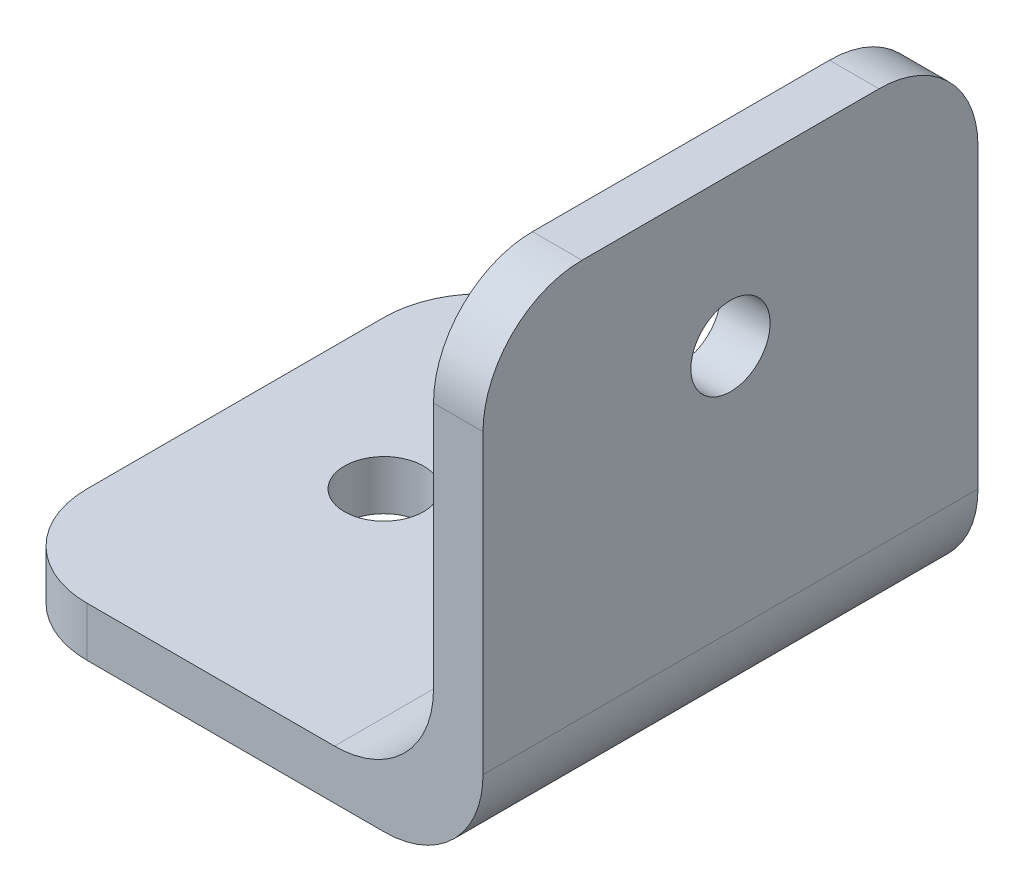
ISO-10303-21;
HEADER;
FILE_DESCRIPTION(('STEP AP214'),'2;1');
FILE_NAME('part.step','',(''),(''),'','','');
FILE_SCHEMA(('AUTOMOTIVE_DESIGN { 1 0 10303 214 1 1 1 1 }'));
ENDSEC;
DATA;
#1=APPLICATION_CONTEXT('core data for automotive mechanical design processes');
#2=APPLICATION_PROTOCOL_DEFINITION('international standard','automotive_design',2000,#1);
#3=PRODUCT_CONTEXT('',#1,'mechanical');
#4=PRODUCT('Part','Part','',(#3));
#5=PRODUCT_RELATED_PRODUCT_CATEGORY('part','',(#4));
#6=PRODUCT_DEFINITION_FORMATION('','',#4);
#7=PRODUCT_DEFINITION_CONTEXT('part definition',#1,'design');
#8=PRODUCT_DEFINITION('design','',#6,#7);
#9=PRODUCT_DEFINITION_SHAPE('','',#8);
#10=(LENGTH_UNIT() NAMED_UNIT(*) SI_UNIT(.MILLI.,.METRE.));
#11=(NAMED_UNIT(*) PLANE_ANGLE_UNIT() SI_UNIT($,.RADIAN.));
#12=(NAMED_UNIT(*) SI_UNIT($,.STERADIAN.) SOLID_ANGLE_UNIT());
#13=UNCERTAINTY_MEASURE_WITH_UNIT(LENGTH_MEASURE(1.E-05),#10,'distance_accuracy_value','');
#14=(GEOMETRIC_REPRESENTATION_CONTEXT(3) GLOBAL_UNCERTAINTY_ASSIGNED_CONTEXT((#13)) GLOBAL_UNIT_ASSIGNED_CONTEXT((#10,
#11,#12)) REPRESENTATION_CONTEXT('',''));
#15=CARTESIAN_POINT('',(0.,0.,0.));
#16=DIRECTION('',(0.,0.,1.));
#17=DIRECTION('',(1.,0.,0.));
#18=AXIS2_PLACEMENT_3D('',#15,#16,#17);
#19=CARTESIAN_POINT('',(0.,0.,50.));
#20=DIRECTION('',(1.,0.,0.));
#21=DIRECTION('',(0.,0.,-1.));
#22=AXIS2_PLACEMENT_3D('',#19,#20,#21);
#23=PLANE('',#22);
#24=DIRECTION('',(0.,0.,-1.));
#25=VECTOR('',#24,1.);
#26=CARTESIAN_POINT('',(0.,5.00000000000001,50.));
#27=LINE('',#26,#25);
#28=CARTESIAN_POINT('',(0.,5.00000000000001,40.));
#29=VERTEX_POINT('',#28);
#30=CARTESIAN_POINT('',(0.,5.00000000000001,9.99999999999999));
#31=VERTEX_POINT('',#30);
#32=EDGE_CURVE('E455',#29,#31,#27,.T.);
#33=ORIENTED_EDGE('',*,*,#32,.T.);
#34=CARTESIAN_POINT('',(0.,15.,10.));
#35=CARTESIAN_POINT('',(0.,11.6666666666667,10.));
#36=CARTESIAN_POINT('',(0.,8.33333333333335,10.));
#37=CARTESIAN_POINT('',(0.,5.00000000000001,10.));
#38=CARTESIAN_POINT('',(0.,3.33333333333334,10.));
#39=CARTESIAN_POINT('',(0.,1.66666666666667,10.));
#40=CARTESIAN_POINT('',(0.,0.,10.));
#41=CARTESIAN_POINT('',(0.,-3.33333333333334,10.));
#42=CARTESIAN_POINT('',(0.,-6.66666666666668,10.));
#43=CARTESIAN_POINT('',(0.,-10.,10.));
#44=(BOUNDED_CURVE() B_SPLINE_CURVE(3,(#34,#35,#36,#37,#38,#39,#40,#41,#42,#43),.UNSPECIFIED.,
.F.,.F.) B_SPLINE_CURVE_WITH_KNOTS((4,3,3,4),(-0.015,-0.00500000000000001,0.,0.01),
.UNSPECIFIED.) CURVE() GEOMETRIC_REPRESENTATION_ITEM() RATIONAL_B_SPLINE_CURVE((1.,1.,1.,1.,1.,
1.,1.,1.,1.,1.)) REPRESENTATION_ITEM(''));
#45=CARTESIAN_POINT('',(0.,0.,9.99999999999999));
#46=VERTEX_POINT('',#45);
#47=EDGE_CURVE('E170',#31,#46,#44,.T.);
#48=ORIENTED_EDGE('',*,*,#47,.T.);
#49=DIRECTION('',(0.,0.,-1.));
#50=VECTOR('',#49,1.);
#51=CARTESIAN_POINT('',(0.,0.,50.));
#52=LINE('',#51,#50);
#53=CARTESIAN_POINT('',(0.,0.,40.));
#54=VERTEX_POINT('',#53);
#55=EDGE_CURVE('E153',#54,#46,#52,.T.);
#56=ORIENTED_EDGE('',*,*,#55,.F.);
#57=CARTESIAN_POINT('',(0.,15.,40.));
#58=CARTESIAN_POINT('',(0.,11.6666666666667,40.));
#59=CARTESIAN_POINT('',(0.,8.33333333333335,40.));
#60=CARTESIAN_POINT('',(0.,5.00000000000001,40.));
#61=CARTESIAN_POINT('',(0.,3.33333333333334,40.));
#62=CARTESIAN_POINT('',(0.,1.66666666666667,40.));
#63=CARTESIAN_POINT('',(0.,0.,40.));
#64=CARTESIAN_POINT('',(0.,-3.33333333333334,40.));
#65=CARTESIAN_POINT('',(0.,-6.66666666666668,40.));
#66=CARTESIAN_POINT('',(0.,-10.,40.));
#67=(BOUNDED_CURVE() B_SPLINE_CURVE(3,(#57,#58,#59,#60,#61,#62,#63,#64,#65,#66),.UNSPECIFIED.,
.F.,.F.) B_SPLINE_CURVE_WITH_KNOTS((4,3,3,4),(-0.015,-0.00500000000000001,0.,0.01),
.UNSPECIFIED.) CURVE() GEOMETRIC_REPRESENTATION_ITEM() RATIONAL_B_SPLINE_CURVE((1.,1.,1.,1.,1.,
1.,1.,1.,1.,1.)) REPRESENTATION_ITEM(''));
#68=EDGE_CURVE('E167',#54,#29,#67,.F.);
#69=ORIENTED_EDGE('',*,*,#68,.T.);
#70=EDGE_LOOP('',(#33,#48,#56,#69));
#71=FACE_BOUND('',#70,.T.);
#72=ADVANCED_FACE('F50',(#71),#23,.F.);
#73=CARTESIAN_POINT('',(0.,0.,50.));
#74=DIRECTION('',(0.,1.,0.));
#75=DIRECTION('',(0.,0.,1.));
#76=AXIS2_PLACEMENT_3D('',#73,#74,#75);
#77=PLANE('',#76);
#78=CARTESIAN_POINT('',(15.,0.,25.));
#79=DIRECTION('',(0.,1.,0.));
#80=DIRECTION('',(0.,0.,1.));
#81=AXIS2_PLACEMENT_3D('',#78,#79,#80);
#82=CIRCLE('',#81,4.);
#83=CARTESIAN_POINT('',(15.,0.,29.));
#84=VERTEX_POINT('',#83);
#85=EDGE_CURVE('E483',#84,#84,#82,.T.);
#86=ORIENTED_EDGE('',*,*,#85,.T.);
#87=EDGE_LOOP('',(#86));
#88=FACE_BOUND('',#87,.T.);
#89=ORIENTED_EDGE('',*,*,#55,.T.);
#90=CARTESIAN_POINT('',(0.,0.,10.));
#91=CARTESIAN_POINT('',(-3.02437820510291E-05,0.,9.71873940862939));
#92=CARTESIAN_POINT('',(0.0118648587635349,0.,9.43748316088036));
#93=CARTESIAN_POINT('',(0.0592873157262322,0.,8.87698298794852));
#94=CARTESIAN_POINT('',(0.0948135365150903,0.,8.59773896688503));
#95=CARTESIAN_POINT('',(0.189244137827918,0.,8.04344901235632));
#96=CARTESIAN_POINT('',(0.248130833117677,0.,7.76840006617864));
#97=CARTESIAN_POINT('',(0.388854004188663,0.,7.22424096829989));
#98=CARTESIAN_POINT('',(0.470690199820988,0.,6.95513074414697));
#99=CARTESIAN_POINT('',(0.656778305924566,0.,6.42463096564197));
#100=CARTESIAN_POINT('',(0.761040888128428,0.,6.16324515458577));
#101=CARTESIAN_POINT('',(0.99121911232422,0.,5.65018139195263));
#102=CARTESIAN_POINT('',(1.1171352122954,0.,5.39850364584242));
#103=CARTESIAN_POINT('',(1.38969862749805,0.,4.90669683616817));
#104=CARTESIAN_POINT('',(1.53634211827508,0.,4.66656565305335));
#105=CARTESIAN_POINT('',(1.8493345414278,0.,4.19951051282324));
#106=CARTESIAN_POINT('',(2.01568336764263,0.,3.97258648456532));
#107=CARTESIAN_POINT('',(2.36690343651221,0.,3.53355882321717));
#108=CARTESIAN_POINT('',(2.55177454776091,0.,3.32145508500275));
#109=CARTESIAN_POINT('',(2.93872607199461,0.,2.91357387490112));
#110=CARTESIAN_POINT('',(3.14080648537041,0.,2.71779640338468));
#111=CARTESIAN_POINT('',(3.56078311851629,0.,2.34392120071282));
#112=CARTESIAN_POINT('',(3.77868255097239,0.,2.165827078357));
#113=CARTESIAN_POINT('',(4.22870763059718,0.,1.82863295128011));
#114=CARTESIAN_POINT('',(4.46083305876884,0.,1.66953265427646));
#115=CARTESIAN_POINT('',(4.93771416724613,0.,1.37142258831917));
#116=CARTESIAN_POINT('',(5.18247251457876,0.,1.23241708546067));
#117=CARTESIAN_POINT('',(5.68282532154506,0.,0.975528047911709));
#118=CARTESIAN_POINT('',(5.93841960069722,0.,0.857644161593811));
#119=CARTESIAN_POINT('',(6.45852377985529,0.,0.643882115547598));
#120=CARTESIAN_POINT('',(6.72302953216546,0.,0.547993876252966));
#121=CARTESIAN_POINT('',(7.25907349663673,0.,0.378859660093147));
#122=CARTESIAN_POINT('',(7.53061000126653,0.,0.305608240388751));
#123=CARTESIAN_POINT('',(8.16492641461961,0.,0.162897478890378));
#124=CARTESIAN_POINT('',(8.52964507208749,0.,0.101812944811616));
#125=CARTESIAN_POINT('',(9.07965111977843,0.,0.0407323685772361));
#126=CARTESIAN_POINT('',(9.26338107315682,0.,0.0254632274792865));
#127=CARTESIAN_POINT('',(9.63139228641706,0.,0.00509827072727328));
#128=CARTESIAN_POINT('',(9.81567351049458,0.,1.80814562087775E-06));
#129=CARTESIAN_POINT('',(10.,0.,0.));
#130=B_SPLINE_CURVE_WITH_KNOTS('',3,(#90,#91,#92,#93,#94,#95,#96,#97,#98,#99,#100,#101,#102,
#103,#104,#105,#106,#107,#108,#109,#110,#111,#112,#113,#114,#115,#116,#117,#118,#119,#120,#121,
#122,#123,#124,#125,#126,#127,#128,#129),.UNSPECIFIED.,.F.,.F.,(4,2,2,2,2,2,2,2,2,2,2,2,2,2,2,2,
2,2,2,4),(0.,0.843524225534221,1.68700798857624,2.52985440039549,3.37269052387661,
4.2159286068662,5.05918452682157,5.90228505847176,6.74538104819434,7.58847105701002,
8.43156108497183,9.27482281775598,10.1180715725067,10.9614990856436,11.804912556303,
12.6479387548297,13.4907620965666,14.5975846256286,15.1504384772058,15.7032571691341),.UNSPECIFIED.);
#131=CARTESIAN_POINT('',(10.,0.,0.));
#132=VERTEX_POINT('',#131);
#133=EDGE_CURVE('E161',#46,#132,#130,.T.);
#134=ORIENTED_EDGE('',*,*,#133,.T.);
#135=DIRECTION('',(1.,0.,0.));
#136=VECTOR('',#135,1.);
#137=CARTESIAN_POINT('',(0.,0.,0.));
#138=LINE('',#137,#136);
#139=CARTESIAN_POINT('',(40.,0.,0.));
#140=VERTEX_POINT('',#139);
#141=EDGE_CURVE('E466',#132,#140,#138,.T.);
#142=ORIENTED_EDGE('',*,*,#141,.T.);
#143=CARTESIAN_POINT('',(40.,0.,150.));
#144=CARTESIAN_POINT('',(40.,0.,116.666666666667));
#145=CARTESIAN_POINT('',(40.,0.,83.3333333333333));
#146=CARTESIAN_POINT('',(40.,0.,50.));
#147=CARTESIAN_POINT('',(40.,0.,33.3333333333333));
#148=CARTESIAN_POINT('',(40.,0.,16.6666666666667));
#149=CARTESIAN_POINT('',(40.,0.,0.));
#150=CARTESIAN_POINT('',(40.,0.,-33.3333333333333));
#151=CARTESIAN_POINT('',(40.,0.,-66.6666666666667));
#152=CARTESIAN_POINT('',(40.,0.,-100.));
#153=(BOUNDED_CURVE() B_SPLINE_CURVE(3,(#143,#144,#145,#146,#147,#148,#149,#150,#151,#152),
.UNSPECIFIED.,.F.,.F.) B_SPLINE_CURVE_WITH_KNOTS((4,3,3,4),(-0.1,0.,0.05,0.15),
.UNSPECIFIED.) CURVE() GEOMETRIC_REPRESENTATION_ITEM() RATIONAL_B_SPLINE_CURVE((1.,1.,1.,1.,1.,
1.,1.,1.,1.,1.)) REPRESENTATION_ITEM(''));
#154=CARTESIAN_POINT('',(40.,0.,50.));
#155=VERTEX_POINT('',#154);
#156=EDGE_CURVE('E162',#140,#155,#153,.F.);
#157=ORIENTED_EDGE('',*,*,#156,.T.);
#158=DIRECTION('',(1.,0.,0.));
#159=VECTOR('',#158,1.);
#160=CARTESIAN_POINT('',(0.,0.,50.));
#161=LINE('',#160,#159);
#162=CARTESIAN_POINT('',(10.,0.,50.));
#163=VERTEX_POINT('',#162);
#164=EDGE_CURVE('E155',#163,#155,#161,.T.);
#165=ORIENTED_EDGE('',*,*,#164,.F.);
#166=CARTESIAN_POINT('',(10.,0.,50.));
#167=CARTESIAN_POINT('',(9.71873940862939,0.,50.0000302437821));
#168=CARTESIAN_POINT('',(9.43748316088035,0.,49.9881351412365));
#169=CARTESIAN_POINT('',(8.87698298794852,0.,49.9407126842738));
#170=CARTESIAN_POINT('',(8.59773896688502,0.,49.9051864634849));
#171=CARTESIAN_POINT('',(8.04344901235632,0.,49.8107558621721));
#172=CARTESIAN_POINT('',(7.76840006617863,0.,49.7518691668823));
#173=CARTESIAN_POINT('',(7.22424096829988,0.,49.6111459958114));
#174=CARTESIAN_POINT('',(6.95513074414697,0.,49.529309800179));
#175=CARTESIAN_POINT('',(6.42463096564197,0.,49.3432216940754));
#176=CARTESIAN_POINT('',(6.16324515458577,0.,49.2389591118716));
#177=CARTESIAN_POINT('',(5.65018139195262,0.,49.0087808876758));
#178=CARTESIAN_POINT('',(5.39850364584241,0.,48.8828647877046));
#179=CARTESIAN_POINT('',(4.90669683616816,0.,48.610301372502));
#180=CARTESIAN_POINT('',(4.66656565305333,0.,48.4636578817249));
#181=CARTESIAN_POINT('',(4.19951051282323,0.,48.1506654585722));
#182=CARTESIAN_POINT('',(3.97258648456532,0.,47.9843166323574));
#183=CARTESIAN_POINT('',(3.53355882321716,0.,47.6330965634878));
#184=CARTESIAN_POINT('',(3.32145508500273,0.,47.4482254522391));
#185=CARTESIAN_POINT('',(2.9135738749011,0.,47.0612739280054));
#186=CARTESIAN_POINT('',(2.71779640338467,0.,46.8591935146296));
#187=CARTESIAN_POINT('',(2.34392120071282,0.,46.4392168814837));
#188=CARTESIAN_POINT('',(2.16582707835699,0.,46.2213174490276));
#189=CARTESIAN_POINT('',(1.8286329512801,0.,45.7712923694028));
#190=CARTESIAN_POINT('',(1.66953265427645,0.,45.5391669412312));
#191=CARTESIAN_POINT('',(1.37142258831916,0.,45.0622858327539));
#192=CARTESIAN_POINT('',(1.23241708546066,0.,44.8175274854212));
#193=CARTESIAN_POINT('',(0.975528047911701,0.,44.3171746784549));
#194=CARTESIAN_POINT('',(0.857644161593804,0.,44.0615803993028));
#195=CARTESIAN_POINT('',(0.643882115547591,0.,43.5414762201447));
#196=CARTESIAN_POINT('',(0.547993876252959,0.,43.2769704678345));
#197=CARTESIAN_POINT('',(0.378859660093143,0.,42.7409265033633));
#198=CARTESIAN_POINT('',(0.305608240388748,0.,42.4693899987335));
#199=CARTESIAN_POINT('',(0.162897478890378,0.,41.8350735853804));
#200=CARTESIAN_POINT('',(0.101812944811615,0.,41.4703549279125));
#201=CARTESIAN_POINT('',(0.0407323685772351,0.,40.9203488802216));
#202=CARTESIAN_POINT('',(0.0254632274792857,0.,40.7366189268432));
#203=CARTESIAN_POINT('',(0.00509827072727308,0.,40.368607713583));
#204=CARTESIAN_POINT('',(1.80814562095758E-06,0.,40.1843264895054));
#205=CARTESIAN_POINT('',(0.,0.,40.));
#206=B_SPLINE_CURVE_WITH_KNOTS('',3,(#166,#167,#168,#169,#170,#171,#172,#173,#174,#175,#176,
#177,#178,#179,#180,#181,#182,#183,#184,#185,#186,#187,#188,#189,#190,#191,#192,#193,#194,#195,
#196,#197,#198,#199,#200,#201,#202,#203,#204,#205),.UNSPECIFIED.,.F.,.F.,(4,2,2,2,2,2,2,2,2,2,2,
2,2,2,2,2,2,2,2,4),(0.,0.843524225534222,1.68700798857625,2.5298544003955,3.37269052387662,
4.2159286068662,5.05918452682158,5.90228505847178,6.74538104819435,7.58847105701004,
8.43156108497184,9.27482281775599,10.1180715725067,10.9614990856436,11.804912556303,
12.6479387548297,13.4907620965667,14.5975846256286,15.1504384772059,15.7032571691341),.UNSPECIFIED.);
#207=EDGE_CURVE('E150',#163,#54,#206,.T.);
#208=ORIENTED_EDGE('',*,*,#207,.T.);
#209=EDGE_LOOP('',(#89,#134,#142,#157,#165,#208));
#210=FACE_BOUND('',#209,.T.);
#211=ADVANCED_FACE('F152',(#88,#210),#77,.F.);
#212=CARTESIAN_POINT('',(50.,0.,50.));
#213=DIRECTION('',(-1.,0.,0.));
#214=DIRECTION('',(0.,0.,1.));
#215=AXIS2_PLACEMENT_3D('',#212,#213,#214);
#216=PLANE('',#215);
#217=CARTESIAN_POINT('',(50.,35.,25.));
#218=DIRECTION('',(-1.,0.,0.));
#219=DIRECTION('',(0.,0.,1.));
#220=AXIS2_PLACEMENT_3D('',#217,#218,#219);
#221=CIRCLE('',#220,4.);
#222=CARTESIAN_POINT('',(50.,35.,29.));
#223=VERTEX_POINT('',#222);
#224=EDGE_CURVE('E469',#223,#223,#221,.T.);
#225=ORIENTED_EDGE('',*,*,#224,.T.);
#226=EDGE_LOOP('',(#225));
#227=FACE_BOUND('',#226,.T.);
#228=DIRECTION('',(0.,1.,0.));
#229=VECTOR('',#228,1.);
#230=CARTESIAN_POINT('',(50.,0.,0.));
#231=LINE('',#230,#229);
#232=CARTESIAN_POINT('',(50.,10.,0.));
#233=VERTEX_POINT('',#232);
#234=CARTESIAN_POINT('',(50.,40.,0.));
#235=VERTEX_POINT('',#234);
#236=EDGE_CURVE('E354',#233,#235,#231,.T.);
#237=ORIENTED_EDGE('',*,*,#236,.T.);
#238=CARTESIAN_POINT('',(50.,40.,0.));
#239=CARTESIAN_POINT('',(50.,40.2812605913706,-3.02437820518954E-05));
#240=CARTESIAN_POINT('',(50.,40.5625168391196,0.0118648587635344));
#241=CARTESIAN_POINT('',(50.,41.1230170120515,0.0592873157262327));
#242=CARTESIAN_POINT('',(50.,41.402261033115,0.0948135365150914));
#243=CARTESIAN_POINT('',(50.,41.9565509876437,0.189244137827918));
#244=CARTESIAN_POINT('',(50.,42.2315999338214,0.248130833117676));
#245=CARTESIAN_POINT('',(50.,42.7757590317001,0.388854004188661));
#246=CARTESIAN_POINT('',(50.,43.044869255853,0.470690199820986));
#247=CARTESIAN_POINT('',(50.,43.575369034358,0.656778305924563));
#248=CARTESIAN_POINT('',(50.,43.8367548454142,0.761040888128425));
#249=CARTESIAN_POINT('',(50.,44.3498186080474,0.991219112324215));
#250=CARTESIAN_POINT('',(50.,44.6014963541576,1.1171352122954));
#251=CARTESIAN_POINT('',(50.,45.0933031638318,1.38969862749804));
#252=CARTESIAN_POINT('',(50.,45.3334343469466,1.53634211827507));
#253=CARTESIAN_POINT('',(50.,45.8004894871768,1.84933454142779));
#254=CARTESIAN_POINT('',(50.,46.0274135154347,2.01568336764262));
#255=CARTESIAN_POINT('',(50.,46.4664411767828,2.3669034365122));
#256=CARTESIAN_POINT('',(50.,46.6785449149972,2.55177454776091));
#257=CARTESIAN_POINT('',(50.,47.0864261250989,2.9387260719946));
#258=CARTESIAN_POINT('',(50.,47.2822035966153,3.1408064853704));
#259=CARTESIAN_POINT('',(50.,47.6560787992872,3.56078311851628));
#260=CARTESIAN_POINT('',(50.,47.834172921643,3.77868255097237));
#261=CARTESIAN_POINT('',(50.,48.1713670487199,4.22870763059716));
#262=CARTESIAN_POINT('',(50.,48.3304673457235,4.46083305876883));
#263=CARTESIAN_POINT('',(50.,48.6285774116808,4.93771416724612));
#264=CARTESIAN_POINT('',(50.,48.7675829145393,5.18247251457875));
#265=CARTESIAN_POINT('',(50.,49.0244719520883,5.68282532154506));
#266=CARTESIAN_POINT('',(50.,49.1423558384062,5.93841960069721));
#267=CARTESIAN_POINT('',(50.,49.3561178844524,6.45852377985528));
#268=CARTESIAN_POINT('',(50.,49.452006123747,6.72302953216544));
#269=CARTESIAN_POINT('',(50.,49.6211403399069,7.25907349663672));
#270=CARTESIAN_POINT('',(50.,49.6943917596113,7.53061000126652));
#271=CARTESIAN_POINT('',(50.,49.8371025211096,8.16492641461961));
#272=CARTESIAN_POINT('',(50.,49.8981870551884,8.52964507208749));
#273=CARTESIAN_POINT('',(50.,49.9592676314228,9.07965111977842));
#274=CARTESIAN_POINT('',(50.,49.9745367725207,9.26338107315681));
#275=CARTESIAN_POINT('',(50.,49.9949017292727,9.63139228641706));
#276=CARTESIAN_POINT('',(50.,49.9999981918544,9.81567351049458));
#277=CARTESIAN_POINT('',(50.,50.,10.));
#278=B_SPLINE_CURVE_WITH_KNOTS('',3,(#238,#239,#240,#241,#242,#243,#244,#245,#246,#247,#248,
#249,#250,#251,#252,#253,#254,#255,#256,#257,#258,#259,#260,#261,#262,#263,#264,#265,#266,#267,
#268,#269,#270,#271,#272,#273,#274,#275,#276,#277),.UNSPECIFIED.,.F.,.F.,(4,2,2,2,2,2,2,2,2,2,2,
2,2,2,2,2,2,2,2,4),(0.,0.843524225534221,1.68700798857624,2.52985440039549,3.37269052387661,
4.21592860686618,5.05918452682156,5.90228505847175,6.74538104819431,7.58847105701,
8.43156108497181,9.27482281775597,10.1180715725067,10.9614990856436,11.804912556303,
12.6479387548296,13.4907620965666,14.5975846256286,15.1504384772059,15.7032571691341),.UNSPECIFIED.);
#279=CARTESIAN_POINT('',(50.,50.,9.99999999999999));
#280=VERTEX_POINT('',#279);
#281=EDGE_CURVE('E75',#235,#280,#278,.T.);
#282=ORIENTED_EDGE('',*,*,#281,.T.);
#283=DIRECTION('',(0.,0.,-1.));
#284=VECTOR('',#283,1.);
#285=CARTESIAN_POINT('',(50.,50.,50.));
#286=LINE('',#285,#284);
#287=CARTESIAN_POINT('',(50.,50.,40.));
#288=VERTEX_POINT('',#287);
#289=EDGE_CURVE('E172',#288,#280,#286,.T.);
#290=ORIENTED_EDGE('',*,*,#289,.F.);
#291=CARTESIAN_POINT('',(50.,50.,40.));
#292=CARTESIAN_POINT('',(50.,50.0000302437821,40.2812605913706));
#293=CARTESIAN_POINT('',(50.,49.9881351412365,40.5625168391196));
#294=CARTESIAN_POINT('',(50.,49.9407126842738,41.1230170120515));
#295=CARTESIAN_POINT('',(50.,49.9051864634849,41.402261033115));
#296=CARTESIAN_POINT('',(50.,49.8107558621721,41.9565509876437));
#297=CARTESIAN_POINT('',(50.,49.7518691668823,42.2315999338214));
#298=CARTESIAN_POINT('',(50.,49.6111459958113,42.7757590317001));
#299=CARTESIAN_POINT('',(50.,49.529309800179,43.044869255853));
#300=CARTESIAN_POINT('',(50.,49.3432216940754,43.575369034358));
#301=CARTESIAN_POINT('',(50.,49.2389591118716,43.8367548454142));
#302=CARTESIAN_POINT('',(50.,49.0087808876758,44.3498186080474));
#303=CARTESIAN_POINT('',(50.,48.8828647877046,44.6014963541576));
#304=CARTESIAN_POINT('',(50.,48.610301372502,45.0933031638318));
#305=CARTESIAN_POINT('',(50.,48.4636578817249,45.3334343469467));
#306=CARTESIAN_POINT('',(50.,48.1506654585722,45.8004894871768));
#307=CARTESIAN_POINT('',(50.,47.9843166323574,46.0274135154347));
#308=CARTESIAN_POINT('',(50.,47.6330965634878,46.4664411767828));
#309=CARTESIAN_POINT('',(50.,47.4482254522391,46.6785449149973));
#310=CARTESIAN_POINT('',(50.,47.0612739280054,47.0864261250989));
#311=CARTESIAN_POINT('',(50.,46.8591935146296,47.2822035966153));
#312=CARTESIAN_POINT('',(50.,46.4392168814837,47.6560787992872));
#313=CARTESIAN_POINT('',(50.,46.2213174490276,47.834172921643));
#314=CARTESIAN_POINT('',(50.,45.7712923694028,48.1713670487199));
#315=CARTESIAN_POINT('',(50.,45.5391669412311,48.3304673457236));
#316=CARTESIAN_POINT('',(50.,45.0622858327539,48.6285774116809));
#317=CARTESIAN_POINT('',(50.,44.8175274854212,48.7675829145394));
#318=CARTESIAN_POINT('',(50.,44.3171746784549,49.0244719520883));
#319=CARTESIAN_POINT('',(50.,44.0615803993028,49.1423558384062));
#320=CARTESIAN_POINT('',(50.,43.5414762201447,49.3561178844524));
#321=CARTESIAN_POINT('',(50.,43.2769704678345,49.452006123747));
#322=CARTESIAN_POINT('',(50.,42.7409265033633,49.6211403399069));
#323=CARTESIAN_POINT('',(50.,42.4693899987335,49.6943917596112));
#324=CARTESIAN_POINT('',(50.,41.8350735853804,49.8371025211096));
#325=CARTESIAN_POINT('',(50.,41.4703549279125,49.8981870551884));
#326=CARTESIAN_POINT('',(50.,40.9203488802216,49.9592676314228));
#327=CARTESIAN_POINT('',(50.,40.7366189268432,49.9745367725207));
#328=CARTESIAN_POINT('',(50.,40.3686077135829,49.9949017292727));
#329=CARTESIAN_POINT('',(50.,40.1843264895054,49.9999981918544));
#330=CARTESIAN_POINT('',(50.,40.,50.));
#331=B_SPLINE_CURVE_WITH_KNOTS('',3,(#291,#292,#293,#294,#295,#296,#297,#298,#299,#300,#301,
#302,#303,#304,#305,#306,#307,#308,#309,#310,#311,#312,#313,#314,#315,#316,#317,#318,#319,#320,
#321,#322,#323,#324,#325,#326,#327,#328,#329,#330),.UNSPECIFIED.,.F.,.F.,(4,2,2,2,2,2,2,2,2,2,2,
2,2,2,2,2,2,2,2,4),(0.,0.843524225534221,1.68700798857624,2.52985440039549,3.37269052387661,
4.21592860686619,5.05918452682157,5.90228505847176,6.74538104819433,7.58847105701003,
8.43156108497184,9.27482281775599,10.1180715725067,10.9614990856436,11.804912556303,
12.6479387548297,13.4907620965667,14.5975846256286,15.1504384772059,15.7032571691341),.UNSPECIFIED.);
#332=CARTESIAN_POINT('',(50.,40.,50.));
#333=VERTEX_POINT('',#332);
#334=EDGE_CURVE('E325',#288,#333,#331,.T.);
#335=ORIENTED_EDGE('',*,*,#334,.T.);
#336=DIRECTION('',(0.,1.,0.));
#337=VECTOR('',#336,1.);
#338=CARTESIAN_POINT('',(50.,0.,50.));
#339=LINE('',#338,#337);
#340=CARTESIAN_POINT('',(50.,10.,50.));
#341=VERTEX_POINT('',#340);
#342=EDGE_CURVE('E403',#341,#333,#339,.T.);
#343=ORIENTED_EDGE('',*,*,#342,.F.);
#344=CARTESIAN_POINT('',(50.,10.,150.));
#345=CARTESIAN_POINT('',(50.,10.,116.666666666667));
#346=CARTESIAN_POINT('',(50.,10.,83.3333333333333));
#347=CARTESIAN_POINT('',(50.,10.,50.));
#348=CARTESIAN_POINT('',(50.,10.,33.3333333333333));
#349=CARTESIAN_POINT('',(50.,10.,16.6666666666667));
#350=CARTESIAN_POINT('',(50.,10.,0.));
#351=CARTESIAN_POINT('',(50.,10.,-33.3333333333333));
#352=CARTESIAN_POINT('',(50.,10.,-66.6666666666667));
#353=CARTESIAN_POINT('',(50.,10.,-100.));
#354=(BOUNDED_CURVE() B_SPLINE_CURVE(3,(#344,#345,#346,#347,#348,#349,#350,#351,#352,#353),
.UNSPECIFIED.,.F.,.F.) B_SPLINE_CURVE_WITH_KNOTS((4,3,3,4),(-0.1,0.,0.05,0.15),
.UNSPECIFIED.) CURVE() GEOMETRIC_REPRESENTATION_ITEM() RATIONAL_B_SPLINE_CURVE((1.,1.,1.,1.,1.,
1.,1.,1.,1.,1.)) REPRESENTATION_ITEM(''));
#355=EDGE_CURVE('E295',#341,#233,#354,.T.);
#356=ORIENTED_EDGE('',*,*,#355,.T.);
#357=EDGE_LOOP('',(#237,#282,#290,#335,#343,#356));
#358=FACE_BOUND('',#357,.T.);
#359=ADVANCED_FACE('F221',(#227,#358),#216,.F.);
#360=CARTESIAN_POINT('',(50.,50.,50.));
#361=DIRECTION('',(0.,-1.,0.));
#362=DIRECTION('',(0.,0.,-1.));
#363=AXIS2_PLACEMENT_3D('',#360,#361,#362);
#364=PLANE('',#363);
#365=ORIENTED_EDGE('',*,*,#289,.T.);
#366=CARTESIAN_POINT('',(60.,50.,10.));
#367=CARTESIAN_POINT('',(56.6666666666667,50.,10.));
#368=CARTESIAN_POINT('',(53.3333333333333,50.,10.));
#369=CARTESIAN_POINT('',(50.,50.,10.));
#370=CARTESIAN_POINT('',(48.3333333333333,50.,10.));
#371=CARTESIAN_POINT('',(46.6666666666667,50.,10.));
#372=CARTESIAN_POINT('',(45.,50.,10.));
#373=CARTESIAN_POINT('',(41.6666666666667,50.,10.));
#374=CARTESIAN_POINT('',(38.3333333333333,50.,10.));
#375=CARTESIAN_POINT('',(35.,50.,10.));
#376=(BOUNDED_CURVE() B_SPLINE_CURVE(3,(#366,#367,#368,#369,#370,#371,#372,#373,#374,#375),
.UNSPECIFIED.,.F.,.F.) B_SPLINE_CURVE_WITH_KNOTS((4,3,3,4),(-0.01,0.,0.005,0.015),
.UNSPECIFIED.) CURVE() GEOMETRIC_REPRESENTATION_ITEM() RATIONAL_B_SPLINE_CURVE((1.,1.,1.,1.,1.,
1.,1.,1.,1.,1.)) REPRESENTATION_ITEM(''));
#377=CARTESIAN_POINT('',(45.,50.,9.99999999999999));
#378=VERTEX_POINT('',#377);
#379=EDGE_CURVE('E358',#280,#378,#376,.T.);
#380=ORIENTED_EDGE('',*,*,#379,.T.);
#381=DIRECTION('',(0.,0.,-1.));
#382=VECTOR('',#381,1.);
#383=CARTESIAN_POINT('',(45.,50.,50.));
#384=LINE('',#383,#382);
#385=CARTESIAN_POINT('',(45.,50.,40.));
#386=VERTEX_POINT('',#385);
#387=EDGE_CURVE('E452',#386,#378,#384,.T.);
#388=ORIENTED_EDGE('',*,*,#387,.F.);
#389=CARTESIAN_POINT('',(60.,50.,40.));
#390=CARTESIAN_POINT('',(56.6666666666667,50.,40.));
#391=CARTESIAN_POINT('',(53.3333333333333,50.,40.));
#392=CARTESIAN_POINT('',(50.,50.,40.));
#393=CARTESIAN_POINT('',(48.3333333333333,50.,40.));
#394=CARTESIAN_POINT('',(46.6666666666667,50.,40.));
#395=CARTESIAN_POINT('',(45.,50.,40.));
#396=CARTESIAN_POINT('',(41.6666666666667,50.,40.));
#397=CARTESIAN_POINT('',(38.3333333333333,50.,40.));
#398=CARTESIAN_POINT('',(35.,50.,40.));
#399=(BOUNDED_CURVE() B_SPLINE_CURVE(3,(#389,#390,#391,#392,#393,#394,#395,#396,#397,#398),
.UNSPECIFIED.,.F.,.F.) B_SPLINE_CURVE_WITH_KNOTS((4,3,3,4),(-0.01,0.,0.005,0.015),
.UNSPECIFIED.) CURVE() GEOMETRIC_REPRESENTATION_ITEM() RATIONAL_B_SPLINE_CURVE((1.,1.,1.,1.,1.,
1.,1.,1.,1.,1.)) REPRESENTATION_ITEM(''));
#400=EDGE_CURVE('E82',#386,#288,#399,.F.);
#401=ORIENTED_EDGE('',*,*,#400,.T.);
#402=EDGE_LOOP('',(#365,#380,#388,#401));
#403=FACE_BOUND('',#402,.T.);
#404=ADVANCED_FACE('F276',(#403),#364,.F.);
#405=CARTESIAN_POINT('',(45.,5.00000000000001,50.));
#406=DIRECTION('',(1.,0.,0.));
#407=DIRECTION('',(0.,0.,-1.));
#408=AXIS2_PLACEMENT_3D('',#405,#406,#407);
#409=PLANE('',#408);
#410=CARTESIAN_POINT('',(45.,35.,25.));
#411=DIRECTION('',(-1.,0.,0.));
#412=DIRECTION('',(0.,0.,1.));
#413=AXIS2_PLACEMENT_3D('',#410,#411,#412);
#414=CIRCLE('',#413,4.);
#415=CARTESIAN_POINT('',(45.,35.,29.));
#416=VERTEX_POINT('',#415);
#417=EDGE_CURVE('E479',#416,#416,#414,.T.);
#418=ORIENTED_EDGE('',*,*,#417,.F.);
#419=EDGE_LOOP('',(#418));
#420=FACE_BOUND('',#419,.T.);
#421=ORIENTED_EDGE('',*,*,#387,.T.);
#422=CARTESIAN_POINT('',(45.,50.,10.));
#423=CARTESIAN_POINT('',(45.,50.0000302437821,9.71873940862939));
#424=CARTESIAN_POINT('',(45.,49.9881351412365,9.43748316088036));
#425=CARTESIAN_POINT('',(45.,49.9407126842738,8.87698298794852));
#426=CARTESIAN_POINT('',(45.,49.9051864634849,8.59773896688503));
#427=CARTESIAN_POINT('',(45.,49.8107558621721,8.04344901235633));
#428=CARTESIAN_POINT('',(45.,49.7518691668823,7.76840006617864));
#429=CARTESIAN_POINT('',(45.,49.6111459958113,7.22424096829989));
#430=CARTESIAN_POINT('',(45.,49.529309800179,6.95513074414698));
#431=CARTESIAN_POINT('',(45.,49.3432216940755,6.42463096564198));
#432=CARTESIAN_POINT('',(45.,49.2389591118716,6.16324515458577));
#433=CARTESIAN_POINT('',(45.,49.0087808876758,5.65018139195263));
#434=CARTESIAN_POINT('',(45.,48.8828647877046,5.39850364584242));
#435=CARTESIAN_POINT('',(45.,48.610301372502,4.90669683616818));
#436=CARTESIAN_POINT('',(45.,48.4636578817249,4.66656565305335));
#437=CARTESIAN_POINT('',(45.,48.1506654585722,4.19951051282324));
#438=CARTESIAN_POINT('',(45.,47.9843166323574,3.97258648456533));
#439=CARTESIAN_POINT('',(45.,47.6330965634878,3.53355882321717));
#440=CARTESIAN_POINT('',(45.,47.4482254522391,3.32145508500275));
#441=CARTESIAN_POINT('',(45.,47.0612739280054,2.91357387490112));
#442=CARTESIAN_POINT('',(45.,46.8591935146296,2.71779640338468));
#443=CARTESIAN_POINT('',(45.,46.4392168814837,2.34392120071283));
#444=CARTESIAN_POINT('',(45.,46.2213174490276,2.165827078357));
#445=CARTESIAN_POINT('',(45.,45.7712923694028,1.82863295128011));
#446=CARTESIAN_POINT('',(45.,45.5391669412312,1.66953265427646));
#447=CARTESIAN_POINT('',(45.,45.0622858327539,1.37142258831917));
#448=CARTESIAN_POINT('',(45.,44.8175274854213,1.23241708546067));
#449=CARTESIAN_POINT('',(45.,44.317174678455,0.975528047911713));
#450=CARTESIAN_POINT('',(45.,44.0615803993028,0.857644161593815));
#451=CARTESIAN_POINT('',(45.,43.5414762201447,0.643882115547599));
#452=CARTESIAN_POINT('',(45.,43.2769704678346,0.547993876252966));
#453=CARTESIAN_POINT('',(45.,42.7409265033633,0.378859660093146));
#454=CARTESIAN_POINT('',(45.,42.4693899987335,0.305608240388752));
#455=CARTESIAN_POINT('',(45.,41.8350735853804,0.162897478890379));
#456=CARTESIAN_POINT('',(45.,41.4703549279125,0.101812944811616));
#457=CARTESIAN_POINT('',(45.,40.9203488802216,0.0407323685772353));
#458=CARTESIAN_POINT('',(45.,40.7366189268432,0.025463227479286));
#459=CARTESIAN_POINT('',(45.,40.368607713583,0.00509827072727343));
#460=CARTESIAN_POINT('',(45.,40.1843264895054,1.80814562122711E-06));
#461=CARTESIAN_POINT('',(45.,40.,0.));
#462=B_SPLINE_CURVE_WITH_KNOTS('',3,(#422,#423,#424,#425,#426,#427,#428,#429,#430,#431,#432,
#433,#434,#435,#436,#437,#438,#439,#440,#441,#442,#443,#444,#445,#446,#447,#448,#449,#450,#451,
#452,#453,#454,#455,#456,#457,#458,#459,#460,#461),.UNSPECIFIED.,.F.,.F.,(4,2,2,2,2,2,2,2,2,2,2,
2,2,2,2,2,2,2,2,4),(0.,0.843524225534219,1.68700798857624,2.52985440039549,3.37269052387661,
4.21592860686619,5.05918452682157,5.90228505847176,6.74538104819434,7.58847105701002,
8.43156108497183,9.27482281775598,10.1180715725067,10.9614990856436,11.804912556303,
12.6479387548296,13.4907620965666,14.5975846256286,15.1504384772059,15.7032571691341),.UNSPECIFIED.);
#463=CARTESIAN_POINT('',(45.,40.,0.));
#464=VERTEX_POINT('',#463);
#465=EDGE_CURVE('E288',#378,#464,#462,.T.);
#466=ORIENTED_EDGE('',*,*,#465,.T.);
#467=DIRECTION('',(0.,-1.,0.));
#468=VECTOR('',#467,1.);
#469=CARTESIAN_POINT('',(45.,5.00000000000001,0.));
#470=LINE('',#469,#468);
#471=CARTESIAN_POINT('',(45.,15.,0.));
#472=VERTEX_POINT('',#471);
#473=EDGE_CURVE('E340',#464,#472,#470,.T.);
#474=ORIENTED_EDGE('',*,*,#473,.T.);
#475=CARTESIAN_POINT('',(45.,15.,150.));
#476=CARTESIAN_POINT('',(45.,15.,116.666666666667));
#477=CARTESIAN_POINT('',(45.,15.,83.3333333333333));
#478=CARTESIAN_POINT('',(45.,15.,50.));
#479=CARTESIAN_POINT('',(45.,15.,33.3333333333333));
#480=CARTESIAN_POINT('',(45.,15.,16.6666666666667));
#481=CARTESIAN_POINT('',(45.,15.,0.));
#482=CARTESIAN_POINT('',(45.,15.,-33.3333333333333));
#483=CARTESIAN_POINT('',(45.,15.,-66.6666666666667));
#484=CARTESIAN_POINT('',(45.,15.,-100.));
#485=(BOUNDED_CURVE() B_SPLINE_CURVE(3,(#475,#476,#477,#478,#479,#480,#481,#482,#483,#484),
.UNSPECIFIED.,.F.,.F.) B_SPLINE_CURVE_WITH_KNOTS((4,3,3,4),(-0.1,0.,0.05,0.15),
.UNSPECIFIED.) CURVE() GEOMETRIC_REPRESENTATION_ITEM() RATIONAL_B_SPLINE_CURVE((1.,1.,1.,1.,1.,
1.,1.,1.,1.,1.)) REPRESENTATION_ITEM(''));
#486=CARTESIAN_POINT('',(45.,15.,50.));
#487=VERTEX_POINT('',#486);
#488=EDGE_CURVE('E351',#472,#487,#485,.F.);
#489=ORIENTED_EDGE('',*,*,#488,.T.);
#490=DIRECTION('',(0.,-1.,0.));
#491=VECTOR('',#490,1.);
#492=CARTESIAN_POINT('',(45.,5.00000000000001,50.));
#493=LINE('',#492,#491);
#494=CARTESIAN_POINT('',(45.,40.,50.));
#495=VERTEX_POINT('',#494);
#496=EDGE_CURVE('E411',#495,#487,#493,.T.);
#497=ORIENTED_EDGE('',*,*,#496,.F.);
#498=CARTESIAN_POINT('',(45.,40.,50.));
#499=CARTESIAN_POINT('',(45.,40.2812605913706,50.0000302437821));
#500=CARTESIAN_POINT('',(45.,40.5625168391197,49.9881351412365));
#501=CARTESIAN_POINT('',(45.,41.1230170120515,49.9407126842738));
#502=CARTESIAN_POINT('',(45.,41.402261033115,49.9051864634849));
#503=CARTESIAN_POINT('',(45.,41.9565509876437,49.8107558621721));
#504=CARTESIAN_POINT('',(45.,42.2315999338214,49.7518691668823));
#505=CARTESIAN_POINT('',(45.,42.7757590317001,49.6111459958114));
#506=CARTESIAN_POINT('',(45.,43.044869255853,49.529309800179));
#507=CARTESIAN_POINT('',(45.,43.575369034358,49.3432216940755));
#508=CARTESIAN_POINT('',(45.,43.8367548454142,49.2389591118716));
#509=CARTESIAN_POINT('',(45.,44.3498186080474,49.0087808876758));
#510=CARTESIAN_POINT('',(45.,44.6014963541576,48.8828647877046));
#511=CARTESIAN_POINT('',(45.,45.0933031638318,48.610301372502));
#512=CARTESIAN_POINT('',(45.,45.3334343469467,48.4636578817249));
#513=CARTESIAN_POINT('',(45.,45.8004894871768,48.1506654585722));
#514=CARTESIAN_POINT('',(45.,46.0274135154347,47.9843166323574));
#515=CARTESIAN_POINT('',(45.,46.4664411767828,47.6330965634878));
#516=CARTESIAN_POINT('',(45.,46.6785449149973,47.4482254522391));
#517=CARTESIAN_POINT('',(45.,47.0864261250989,47.0612739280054));
#518=CARTESIAN_POINT('',(45.,47.2822035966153,46.8591935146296));
#519=CARTESIAN_POINT('',(45.,47.6560787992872,46.4392168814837));
#520=CARTESIAN_POINT('',(45.,47.834172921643,46.2213174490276));
#521=CARTESIAN_POINT('',(45.,48.1713670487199,45.7712923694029));
#522=CARTESIAN_POINT('',(45.,48.3304673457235,45.5391669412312));
#523=CARTESIAN_POINT('',(45.,48.6285774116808,45.0622858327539));
#524=CARTESIAN_POINT('',(45.,48.7675829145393,44.8175274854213));
#525=CARTESIAN_POINT('',(45.,49.0244719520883,44.317174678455));
#526=CARTESIAN_POINT('',(45.,49.1423558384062,44.0615803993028));
#527=CARTESIAN_POINT('',(45.,49.3561178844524,43.5414762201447));
#528=CARTESIAN_POINT('',(45.,49.452006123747,43.2769704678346));
#529=CARTESIAN_POINT('',(45.,49.6211403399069,42.7409265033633));
#530=CARTESIAN_POINT('',(45.,49.6943917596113,42.4693899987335));
#531=CARTESIAN_POINT('',(45.,49.8371025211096,41.8350735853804));
#532=CARTESIAN_POINT('',(45.,49.8981870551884,41.4703549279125));
#533=CARTESIAN_POINT('',(45.,49.9592676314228,40.9203488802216));
#534=CARTESIAN_POINT('',(45.,49.9745367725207,40.7366189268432));
#535=CARTESIAN_POINT('',(45.,49.9949017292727,40.368607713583));
#536=CARTESIAN_POINT('',(45.,49.9999981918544,40.1843264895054));
#537=CARTESIAN_POINT('',(45.,50.,40.));
#538=B_SPLINE_CURVE_WITH_KNOTS('',3,(#498,#499,#500,#501,#502,#503,#504,#505,#506,#507,#508,
#509,#510,#511,#512,#513,#514,#515,#516,#517,#518,#519,#520,#521,#522,#523,#524,#525,#526,#527,
#528,#529,#530,#531,#532,#533,#534,#535,#536,#537),.UNSPECIFIED.,.F.,.F.,(4,2,2,2,2,2,2,2,2,2,2,
2,2,2,2,2,2,2,2,4),(0.,0.843524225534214,1.68700798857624,2.52985440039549,3.3726905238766,
4.21592860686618,5.05918452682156,5.90228505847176,6.74538104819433,7.58847105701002,
8.43156108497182,9.27482281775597,10.1180715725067,10.9614990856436,11.804912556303,
12.6479387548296,13.4907620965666,14.5975846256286,15.1504384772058,15.7032571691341),.UNSPECIFIED.);
#539=EDGE_CURVE('E280',#495,#386,#538,.T.);
#540=ORIENTED_EDGE('',*,*,#539,.T.);
#541=EDGE_LOOP('',(#421,#466,#474,#489,#497,#540));
#542=FACE_BOUND('',#541,.T.);
#543=ADVANCED_FACE('F270',(#420,#542),#409,.F.);
#544=CARTESIAN_POINT('',(0.,5.00000000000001,50.));
#545=DIRECTION('',(0.,-1.,0.));
#546=DIRECTION('',(0.,0.,-1.));
#547=AXIS2_PLACEMENT_3D('',#544,#545,#546);
#548=PLANE('',#547);
#549=CARTESIAN_POINT('',(15.,5.00000000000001,25.));
#550=DIRECTION('',(0.,1.,0.));
#551=DIRECTION('',(0.,0.,1.));
#552=AXIS2_PLACEMENT_3D('',#549,#550,#551);
#553=CIRCLE('',#552,4.);
#554=CARTESIAN_POINT('',(15.,5.00000000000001,29.));
#555=VERTEX_POINT('',#554);
#556=EDGE_CURVE('E487',#555,#555,#553,.T.);
#557=ORIENTED_EDGE('',*,*,#556,.F.);
#558=EDGE_LOOP('',(#557));
#559=FACE_BOUND('',#558,.T.);
#560=DIRECTION('',(-1.,0.,0.));
#561=VECTOR('',#560,1.);
#562=CARTESIAN_POINT('',(0.,5.00000000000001,0.));
#563=LINE('',#562,#561);
#564=CARTESIAN_POINT('',(35.,5.00000000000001,0.));
#565=VERTEX_POINT('',#564);
#566=CARTESIAN_POINT('',(9.99999999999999,5.00000000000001,0.));
#567=VERTEX_POINT('',#566);
#568=EDGE_CURVE('E343',#565,#567,#563,.T.);
#569=ORIENTED_EDGE('',*,*,#568,.T.);
#570=CARTESIAN_POINT('',(10.,5.00000000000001,0.));
#571=CARTESIAN_POINT('',(9.71873940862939,5.00000000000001,-3.02437820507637E-05));
#572=CARTESIAN_POINT('',(9.43748316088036,5.00000000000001,0.0118648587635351));
#573=CARTESIAN_POINT('',(8.87698298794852,5.00000000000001,0.0592873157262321));
#574=CARTESIAN_POINT('',(8.59773896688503,5.00000000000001,0.0948135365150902));
#575=CARTESIAN_POINT('',(8.04344901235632,5.00000000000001,0.189244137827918));
#576=CARTESIAN_POINT('',(7.76840006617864,5.00000000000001,0.248130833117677));
#577=CARTESIAN_POINT('',(7.22424096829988,5.00000000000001,0.388854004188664));
#578=CARTESIAN_POINT('',(6.95513074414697,5.00000000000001,0.470690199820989));
#579=CARTESIAN_POINT('',(6.42463096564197,5.00000000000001,0.656778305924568));
#580=CARTESIAN_POINT('',(6.16324515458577,5.00000000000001,0.76104088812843));
#581=CARTESIAN_POINT('',(5.65018139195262,5.00000000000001,0.991219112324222));
#582=CARTESIAN_POINT('',(5.39850364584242,5.00000000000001,1.11713521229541));
#583=CARTESIAN_POINT('',(4.90669683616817,5.00000000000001,1.38969862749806));
#584=CARTESIAN_POINT('',(4.66656565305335,5.00000000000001,1.53634211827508));
#585=CARTESIAN_POINT('',(4.19951051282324,5.00000000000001,1.8493345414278));
#586=CARTESIAN_POINT('',(3.97258648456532,5.00000000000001,2.01568336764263));
#587=CARTESIAN_POINT('',(3.53355882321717,5.00000000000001,2.36690343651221));
#588=CARTESIAN_POINT('',(3.32145508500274,5.00000000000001,2.55177454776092));
#589=CARTESIAN_POINT('',(2.91357387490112,5.00000000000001,2.93872607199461));
#590=CARTESIAN_POINT('',(2.71779640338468,5.00000000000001,3.14080648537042));
#591=CARTESIAN_POINT('',(2.34392120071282,5.00000000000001,3.56078311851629));
#592=CARTESIAN_POINT('',(2.16582707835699,5.00000000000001,3.77868255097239));
#593=CARTESIAN_POINT('',(1.82863295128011,5.00000000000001,4.22870763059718));
#594=CARTESIAN_POINT('',(1.66953265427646,5.00000000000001,4.46083305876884));
#595=CARTESIAN_POINT('',(1.37142258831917,5.00000000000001,4.93771416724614));
#596=CARTESIAN_POINT('',(1.23241708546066,5.00000000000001,5.18247251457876));
#597=CARTESIAN_POINT('',(0.975528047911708,5.00000000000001,5.68282532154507));
#598=CARTESIAN_POINT('',(0.85764416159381,5.00000000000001,5.93841960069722));
#599=CARTESIAN_POINT('',(0.643882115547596,5.00000000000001,6.45852377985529));
#600=CARTESIAN_POINT('',(0.547993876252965,5.00000000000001,6.72302953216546));
#601=CARTESIAN_POINT('',(0.378859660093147,5.00000000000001,7.25907349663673));
#602=CARTESIAN_POINT('',(0.305608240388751,5.00000000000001,7.53061000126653));
#603=CARTESIAN_POINT('',(0.162897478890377,5.00000000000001,8.16492641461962));
#604=CARTESIAN_POINT('',(0.101812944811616,5.00000000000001,8.5296450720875));
#605=CARTESIAN_POINT('',(0.0407323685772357,5.00000000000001,9.07965111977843));
#606=CARTESIAN_POINT('',(0.0254632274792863,5.00000000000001,9.26338107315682));
#607=CARTESIAN_POINT('',(0.00509827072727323,5.00000000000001,9.63139228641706));
#608=CARTESIAN_POINT('',(1.80814562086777E-06,5.00000000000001,9.81567351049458));
#609=CARTESIAN_POINT('',(0.,5.00000000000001,10.));
#610=B_SPLINE_CURVE_WITH_KNOTS('',3,(#570,#571,#572,#573,#574,#575,#576,#577,#578,#579,#580,
#581,#582,#583,#584,#585,#586,#587,#588,#589,#590,#591,#592,#593,#594,#595,#596,#597,#598,#599,
#600,#601,#602,#603,#604,#605,#606,#607,#608,#609),.UNSPECIFIED.,.F.,.F.,(4,2,2,2,2,2,2,2,2,2,2,
2,2,2,2,2,2,2,2,4),(0.,0.843524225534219,1.68700798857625,2.52985440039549,3.37269052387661,
4.2159286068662,5.05918452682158,5.90228505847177,6.74538104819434,7.58847105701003,
8.43156108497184,9.27482281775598,10.1180715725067,10.9614990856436,11.804912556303,
12.6479387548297,13.4907620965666,14.5975846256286,15.1504384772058,15.7032571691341),.UNSPECIFIED.);
#611=EDGE_CURVE('E244',#567,#31,#610,.T.);
#612=ORIENTED_EDGE('',*,*,#611,.T.);
#613=ORIENTED_EDGE('',*,*,#32,.F.);
#614=CARTESIAN_POINT('',(0.,5.00000000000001,40.));
#615=CARTESIAN_POINT('',(-3.02437820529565E-05,5.00000000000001,40.2812605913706));
#616=CARTESIAN_POINT('',(0.0118648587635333,5.00000000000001,40.5625168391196));
#617=CARTESIAN_POINT('',(0.0592873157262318,5.00000000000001,41.1230170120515));
#618=CARTESIAN_POINT('',(0.0948135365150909,5.00000000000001,41.402261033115));
#619=CARTESIAN_POINT('',(0.189244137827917,5.00000000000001,41.9565509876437));
#620=CARTESIAN_POINT('',(0.248130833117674,5.00000000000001,42.2315999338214));
#621=CARTESIAN_POINT('',(0.38885400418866,5.00000000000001,42.7757590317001));
#622=CARTESIAN_POINT('',(0.470690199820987,5.00000000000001,43.044869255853));
#623=CARTESIAN_POINT('',(0.656778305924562,5.00000000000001,43.575369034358));
#624=CARTESIAN_POINT('',(0.761040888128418,5.00000000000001,43.8367548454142));
#625=CARTESIAN_POINT('',(0.991219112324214,5.00000000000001,44.3498186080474));
#626=CARTESIAN_POINT('',(1.11713521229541,5.00000000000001,44.6014963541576));
#627=CARTESIAN_POINT('',(1.38969862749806,5.00000000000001,45.0933031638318));
#628=CARTESIAN_POINT('',(1.53634211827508,5.00000000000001,45.3334343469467));
#629=CARTESIAN_POINT('',(1.84933454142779,5.00000000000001,45.8004894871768));
#630=CARTESIAN_POINT('',(2.01568336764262,5.00000000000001,46.0274135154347));
#631=CARTESIAN_POINT('',(2.3669034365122,5.00000000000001,46.4664411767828));
#632=CARTESIAN_POINT('',(2.5517745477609,5.00000000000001,46.6785449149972));
#633=CARTESIAN_POINT('',(2.93872607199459,5.00000000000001,47.0864261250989));
#634=CARTESIAN_POINT('',(3.14080648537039,5.00000000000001,47.2822035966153));
#635=CARTESIAN_POINT('',(3.56078311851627,5.00000000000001,47.6560787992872));
#636=CARTESIAN_POINT('',(3.77868255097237,5.00000000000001,47.834172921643));
#637=CARTESIAN_POINT('',(4.22870763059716,5.00000000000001,48.1713670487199));
#638=CARTESIAN_POINT('',(4.46083305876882,5.00000000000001,48.3304673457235));
#639=CARTESIAN_POINT('',(4.93771416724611,5.00000000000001,48.6285774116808));
#640=CARTESIAN_POINT('',(5.18247251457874,5.00000000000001,48.7675829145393));
#641=CARTESIAN_POINT('',(5.68282532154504,5.00000000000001,49.0244719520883));
#642=CARTESIAN_POINT('',(5.9384196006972,5.00000000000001,49.1423558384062));
#643=CARTESIAN_POINT('',(6.45852377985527,5.00000000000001,49.3561178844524));
#644=CARTESIAN_POINT('',(6.72302953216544,5.00000000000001,49.452006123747));
#645=CARTESIAN_POINT('',(7.25907349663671,5.00000000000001,49.6211403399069));
#646=CARTESIAN_POINT('',(7.53061000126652,5.00000000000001,49.6943917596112));
#647=CARTESIAN_POINT('',(8.1649264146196,5.00000000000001,49.8371025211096));
#648=CARTESIAN_POINT('',(8.52964507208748,5.00000000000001,49.8981870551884));
#649=CARTESIAN_POINT('',(9.07965111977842,5.00000000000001,49.9592676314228));
#650=CARTESIAN_POINT('',(9.26338107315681,5.00000000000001,49.9745367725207));
#651=CARTESIAN_POINT('',(9.63139228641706,5.00000000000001,49.9949017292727));
#652=CARTESIAN_POINT('',(9.81567351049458,5.00000000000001,49.9999981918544));
#653=CARTESIAN_POINT('',(10.,5.00000000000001,50.));
#654=B_SPLINE_CURVE_WITH_KNOTS('',3,(#614,#615,#616,#617,#618,#619,#620,#621,#622,#623,#624,
#625,#626,#627,#628,#629,#630,#631,#632,#633,#634,#635,#636,#637,#638,#639,#640,#641,#642,#643,
#644,#645,#646,#647,#648,#649,#650,#651,#652,#653),.UNSPECIFIED.,.F.,.F.,(4,2,2,2,2,2,2,2,2,2,2,
2,2,2,2,2,2,2,2,4),(0.,0.843524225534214,1.68700798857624,2.52985440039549,3.37269052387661,
4.21592860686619,5.05918452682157,5.90228505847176,6.74538104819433,7.58847105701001,
8.43156108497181,9.27482281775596,10.1180715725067,10.9614990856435,11.804912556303,
12.6479387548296,13.4907620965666,14.5975846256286,15.1504384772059,15.7032571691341),.UNSPECIFIED.);
#655=CARTESIAN_POINT('',(9.99999999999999,5.00000000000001,50.));
#656=VERTEX_POINT('',#655);
#657=EDGE_CURVE('E176',#29,#656,#654,.T.);
#658=ORIENTED_EDGE('',*,*,#657,.T.);
#659=DIRECTION('',(-1.,0.,0.));
#660=VECTOR('',#659,1.);
#661=CARTESIAN_POINT('',(0.,5.00000000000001,50.));
#662=LINE('',#661,#660);
#663=CARTESIAN_POINT('',(35.,5.00000000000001,50.));
#664=VERTEX_POINT('',#663);
#665=EDGE_CURVE('E459',#664,#656,#662,.T.);
#666=ORIENTED_EDGE('',*,*,#665,.F.);
#667=CARTESIAN_POINT('',(35.,5.00000000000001,150.));
#668=CARTESIAN_POINT('',(35.,5.00000000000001,116.666666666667));
#669=CARTESIAN_POINT('',(35.,5.00000000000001,83.3333333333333));
#670=CARTESIAN_POINT('',(35.,5.00000000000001,50.));
#671=CARTESIAN_POINT('',(35.,5.00000000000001,33.3333333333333));
#672=CARTESIAN_POINT('',(35.,5.00000000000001,16.6666666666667));
#673=CARTESIAN_POINT('',(35.,5.00000000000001,0.));
#674=CARTESIAN_POINT('',(35.,5.00000000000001,-33.3333333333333));
#675=CARTESIAN_POINT('',(35.,5.00000000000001,-66.6666666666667));
#676=CARTESIAN_POINT('',(35.,5.00000000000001,-100.));
#677=(BOUNDED_CURVE() B_SPLINE_CURVE(3,(#667,#668,#669,#670,#671,#672,#673,#674,#675,#676),
.UNSPECIFIED.,.F.,.F.) B_SPLINE_CURVE_WITH_KNOTS((4,3,3,4),(-0.1,0.,0.05,0.15),
.UNSPECIFIED.) CURVE() GEOMETRIC_REPRESENTATION_ITEM() RATIONAL_B_SPLINE_CURVE((1.,1.,1.,1.,1.,
1.,1.,1.,1.,1.)) REPRESENTATION_ITEM(''));
#678=EDGE_CURVE('E497',#664,#565,#677,.T.);
#679=ORIENTED_EDGE('',*,*,#678,.T.);
#680=EDGE_LOOP('',(#569,#612,#613,#658,#666,#679));
#681=FACE_BOUND('',#680,.T.);
#682=ADVANCED_FACE('F264',(#559,#681),#548,.F.);
#683=CARTESIAN_POINT('',(0.,0.,50.));
#684=DIRECTION('',(0.,0.,-1.));
#685=DIRECTION('',(-1.,0.,0.));
#686=AXIS2_PLACEMENT_3D('',#683,#684,#685);
#687=PLANE('',#686);
#688=ORIENTED_EDGE('',*,*,#665,.T.);
#689=CARTESIAN_POINT('',(10.,15.,50.));
#690=CARTESIAN_POINT('',(10.,11.6666666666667,50.));
#691=CARTESIAN_POINT('',(10.,8.33333333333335,50.));
#692=CARTESIAN_POINT('',(10.,5.00000000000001,50.));
#693=CARTESIAN_POINT('',(10.,3.33333333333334,50.));
#694=CARTESIAN_POINT('',(10.,1.66666666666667,50.));
#695=CARTESIAN_POINT('',(10.,0.,50.));
#696=CARTESIAN_POINT('',(10.,-3.33333333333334,50.));
#697=CARTESIAN_POINT('',(10.,-6.66666666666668,50.));
#698=CARTESIAN_POINT('',(10.,-10.,50.));
#699=(BOUNDED_CURVE() B_SPLINE_CURVE(3,(#689,#690,#691,#692,#693,#694,#695,#696,#697,#698),
.UNSPECIFIED.,.F.,.F.) B_SPLINE_CURVE_WITH_KNOTS((4,3,3,4),(-0.015,-0.00500000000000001,0.,
0.01),.UNSPECIFIED.) CURVE() GEOMETRIC_REPRESENTATION_ITEM() RATIONAL_B_SPLINE_CURVE((1.,1.,1.,
1.,1.,1.,1.,1.,1.,1.)) REPRESENTATION_ITEM(''));
#700=EDGE_CURVE('E378',#656,#163,#699,.T.);
#701=ORIENTED_EDGE('',*,*,#700,.T.);
#702=ORIENTED_EDGE('',*,*,#164,.T.);
#703=CARTESIAN_POINT('',(40.,0.,50.));
#704=CARTESIAN_POINT('',(40.2812605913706,-3.02437820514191E-05,50.));
#705=CARTESIAN_POINT('',(40.5625168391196,0.0118648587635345,50.));
#706=CARTESIAN_POINT('',(41.1230170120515,0.0592873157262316,50.));
#707=CARTESIAN_POINT('',(41.402261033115,0.0948135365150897,50.));
#708=CARTESIAN_POINT('',(41.9565509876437,0.189244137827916,50.));
#709=CARTESIAN_POINT('',(42.2315999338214,0.248130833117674,50.));
#710=CARTESIAN_POINT('',(42.7757590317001,0.38885400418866,50.));
#711=CARTESIAN_POINT('',(43.044869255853,0.470690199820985,50.));
#712=CARTESIAN_POINT('',(43.575369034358,0.656778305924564,50.));
#713=CARTESIAN_POINT('',(43.8367548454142,0.761040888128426,50.));
#714=CARTESIAN_POINT('',(44.3498186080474,0.99121911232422,50.));
#715=CARTESIAN_POINT('',(44.6014963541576,1.11713521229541,50.));
#716=CARTESIAN_POINT('',(45.0933031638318,1.38969862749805,50.));
#717=CARTESIAN_POINT('',(45.3334343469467,1.53634211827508,50.));
#718=CARTESIAN_POINT('',(45.8004894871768,1.84933454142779,50.));
#719=CARTESIAN_POINT('',(46.0274135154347,2.01568336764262,50.));
#720=CARTESIAN_POINT('',(46.4664411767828,2.36690343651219,50.));
#721=CARTESIAN_POINT('',(46.6785449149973,2.5517745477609,50.));
#722=CARTESIAN_POINT('',(47.0864261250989,2.9387260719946,50.));
#723=CARTESIAN_POINT('',(47.2822035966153,3.1408064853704,50.));
#724=CARTESIAN_POINT('',(47.6560787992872,3.56078311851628,50.));
#725=CARTESIAN_POINT('',(47.834172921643,3.77868255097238,50.));
#726=CARTESIAN_POINT('',(48.1713670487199,4.22870763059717,50.));
#727=CARTESIAN_POINT('',(48.3304673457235,4.46083305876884,50.));
#728=CARTESIAN_POINT('',(48.6285774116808,4.93771416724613,50.));
#729=CARTESIAN_POINT('',(48.7675829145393,5.18247251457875,50.));
#730=CARTESIAN_POINT('',(49.0244719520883,5.68282532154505,50.));
#731=CARTESIAN_POINT('',(49.1423558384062,5.93841960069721,50.));
#732=CARTESIAN_POINT('',(49.3561178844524,6.45852377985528,50.));
#733=CARTESIAN_POINT('',(49.452006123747,6.72302953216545,50.));
#734=CARTESIAN_POINT('',(49.6211403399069,7.25907349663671,50.));
#735=CARTESIAN_POINT('',(49.6943917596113,7.53061000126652,50.));
#736=CARTESIAN_POINT('',(49.8371025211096,8.1649264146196,50.));
#737=CARTESIAN_POINT('',(49.8981870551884,8.52964507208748,50.));
#738=CARTESIAN_POINT('',(49.9592676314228,9.07965111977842,50.));
#739=CARTESIAN_POINT('',(49.9745367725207,9.26338107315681,50.));
#740=CARTESIAN_POINT('',(49.9949017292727,9.63139228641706,50.));
#741=CARTESIAN_POINT('',(49.9999981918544,9.81567351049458,50.));
#742=CARTESIAN_POINT('',(50.,10.,50.));
#743=B_SPLINE_CURVE_WITH_KNOTS('',3,(#703,#704,#705,#706,#707,#708,#709,#710,#711,#712,#713,
#714,#715,#716,#717,#718,#719,#720,#721,#722,#723,#724,#725,#726,#727,#728,#729,#730,#731,#732,
#733,#734,#735,#736,#737,#738,#739,#740,#741,#742),.UNSPECIFIED.,.F.,.F.,(4,2,2,2,2,2,2,2,2,2,2,
2,2,2,2,2,2,2,2,4),(0.,0.843524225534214,1.68700798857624,2.52985440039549,3.37269052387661,
4.21592860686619,5.05918452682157,5.90228505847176,6.74538104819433,7.58847105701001,
8.43156108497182,9.27482281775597,10.1180715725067,10.9614990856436,11.804912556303,
12.6479387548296,13.4907620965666,14.5975846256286,15.1504384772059,15.7032571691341),.UNSPECIFIED.);
#744=EDGE_CURVE('E253',#155,#341,#743,.T.);
#745=ORIENTED_EDGE('',*,*,#744,.T.);
#746=ORIENTED_EDGE('',*,*,#342,.T.);
#747=CARTESIAN_POINT('',(60.,40.,50.));
#748=CARTESIAN_POINT('',(56.6666666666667,40.,50.));
#749=CARTESIAN_POINT('',(53.3333333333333,40.,50.));
#750=CARTESIAN_POINT('',(50.,40.,50.));
#751=CARTESIAN_POINT('',(48.3333333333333,40.,50.));
#752=CARTESIAN_POINT('',(46.6666666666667,40.,50.));
#753=CARTESIAN_POINT('',(45.,40.,50.));
#754=CARTESIAN_POINT('',(41.6666666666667,40.,50.));
#755=CARTESIAN_POINT('',(38.3333333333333,40.,50.));
#756=CARTESIAN_POINT('',(35.,40.,50.));
#757=(BOUNDED_CURVE() B_SPLINE_CURVE(3,(#747,#748,#749,#750,#751,#752,#753,#754,#755,#756),
.UNSPECIFIED.,.F.,.F.) B_SPLINE_CURVE_WITH_KNOTS((4,3,3,4),(-0.01,0.,0.005,0.015),
.UNSPECIFIED.) CURVE() GEOMETRIC_REPRESENTATION_ITEM() RATIONAL_B_SPLINE_CURVE((1.,1.,1.,1.,1.,
1.,1.,1.,1.,1.)) REPRESENTATION_ITEM(''));
#758=EDGE_CURVE('E385',#333,#495,#757,.T.);
#759=ORIENTED_EDGE('',*,*,#758,.T.);
#760=ORIENTED_EDGE('',*,*,#496,.T.);
#761=CARTESIAN_POINT('',(45.,15.,50.));
#762=CARTESIAN_POINT('',(45.0000302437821,14.7187394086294,50.));
#763=CARTESIAN_POINT('',(44.9881351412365,14.4374831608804,50.));
#764=CARTESIAN_POINT('',(44.9407126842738,13.8769829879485,50.));
#765=CARTESIAN_POINT('',(44.9051864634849,13.597738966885,50.));
#766=CARTESIAN_POINT('',(44.8107558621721,13.0434490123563,50.));
#767=CARTESIAN_POINT('',(44.7518691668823,12.7684000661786,50.));
#768=CARTESIAN_POINT('',(44.6111459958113,12.2242409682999,50.));
#769=CARTESIAN_POINT('',(44.529309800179,11.955130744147,50.));
#770=CARTESIAN_POINT('',(44.3432216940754,11.424630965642,50.));
#771=CARTESIAN_POINT('',(44.2389591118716,11.1632451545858,50.));
#772=CARTESIAN_POINT('',(44.0087808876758,10.6501813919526,50.));
#773=CARTESIAN_POINT('',(43.8828647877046,10.3985036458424,50.));
#774=CARTESIAN_POINT('',(43.610301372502,9.90669683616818,50.));
#775=CARTESIAN_POINT('',(43.4636578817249,9.66656565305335,50.));
#776=CARTESIAN_POINT('',(43.1506654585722,9.19951051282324,50.));
#777=CARTESIAN_POINT('',(42.9843166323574,8.97258648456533,50.));
#778=CARTESIAN_POINT('',(42.6330965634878,8.53355882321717,50.));
#779=CARTESIAN_POINT('',(42.4482254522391,8.32145508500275,50.));
#780=CARTESIAN_POINT('',(42.0612739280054,7.91357387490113,50.));
#781=CARTESIAN_POINT('',(41.8591935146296,7.71779640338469,50.));
#782=CARTESIAN_POINT('',(41.4392168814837,7.34392120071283,50.));
#783=CARTESIAN_POINT('',(41.2213174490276,7.165827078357,50.));
#784=CARTESIAN_POINT('',(40.7712923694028,6.82863295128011,50.));
#785=CARTESIAN_POINT('',(40.5391669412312,6.66953265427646,50.));
#786=CARTESIAN_POINT('',(40.0622858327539,6.37142258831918,50.));
#787=CARTESIAN_POINT('',(39.8175274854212,6.23241708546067,50.));
#788=CARTESIAN_POINT('',(39.3171746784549,5.97552804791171,50.));
#789=CARTESIAN_POINT('',(39.0615803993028,5.85764416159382,50.));
#790=CARTESIAN_POINT('',(38.5414762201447,5.6438821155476,50.));
#791=CARTESIAN_POINT('',(38.2769704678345,5.54799387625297,50.));
#792=CARTESIAN_POINT('',(37.7409265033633,5.37885966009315,50.));
#793=CARTESIAN_POINT('',(37.4693899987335,5.30560824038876,50.));
#794=CARTESIAN_POINT('',(36.8350735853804,5.16289747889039,50.));
#795=CARTESIAN_POINT('',(36.4703549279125,5.10181294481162,50.));
#796=CARTESIAN_POINT('',(35.9203488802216,5.04073236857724,50.));
#797=CARTESIAN_POINT('',(35.7366189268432,5.02546322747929,50.));
#798=CARTESIAN_POINT('',(35.3686077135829,5.00509827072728,50.));
#799=CARTESIAN_POINT('',(35.1843264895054,5.00000180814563,50.));
#800=CARTESIAN_POINT('',(35.,5.00000000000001,50.));
#801=B_SPLINE_CURVE_WITH_KNOTS('',3,(#761,#762,#763,#764,#765,#766,#767,#768,#769,#770,#771,
#772,#773,#774,#775,#776,#777,#778,#779,#780,#781,#782,#783,#784,#785,#786,#787,#788,#789,#790,
#791,#792,#793,#794,#795,#796,#797,#798,#799,#800),.UNSPECIFIED.,.F.,.F.,(4,2,2,2,2,2,2,2,2,2,2,
2,2,2,2,2,2,2,2,4),(0.,0.843524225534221,1.68700798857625,2.52985440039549,3.37269052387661,
4.2159286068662,5.05918452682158,5.90228505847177,6.74538104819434,7.58847105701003,
8.43156108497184,9.27482281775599,10.1180715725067,10.9614990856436,11.804912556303,
12.6479387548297,13.4907620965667,14.5975846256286,15.1504384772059,15.7032571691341),.UNSPECIFIED.);
#802=EDGE_CURVE('E12',#487,#664,#801,.T.);
#803=ORIENTED_EDGE('',*,*,#802,.T.);
#804=EDGE_LOOP('',(#688,#701,#702,#745,#746,#759,#760,#803));
#805=FACE_BOUND('',#804,.T.);
#806=ADVANCED_FACE('F269',(#805),#687,.F.);
#807=CARTESIAN_POINT('',(0.,0.,0.));
#808=DIRECTION('',(0.,0.,-1.));
#809=DIRECTION('',(-1.,0.,0.));
#810=AXIS2_PLACEMENT_3D('',#807,#808,#809);
#811=PLANE('',#810);
#812=ORIENTED_EDGE('',*,*,#141,.F.);
#813=CARTESIAN_POINT('',(10.,15.,0.));
#814=CARTESIAN_POINT('',(10.,11.6666666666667,0.));
#815=CARTESIAN_POINT('',(10.,8.33333333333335,0.));
#816=CARTESIAN_POINT('',(10.,5.00000000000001,0.));
#817=CARTESIAN_POINT('',(10.,3.33333333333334,0.));
#818=CARTESIAN_POINT('',(10.,1.66666666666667,0.));
#819=CARTESIAN_POINT('',(10.,0.,0.));
#820=CARTESIAN_POINT('',(10.,-3.33333333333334,0.));
#821=CARTESIAN_POINT('',(10.,-6.66666666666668,0.));
#822=CARTESIAN_POINT('',(10.,-10.,0.));
#823=(BOUNDED_CURVE() B_SPLINE_CURVE(3,(#813,#814,#815,#816,#817,#818,#819,#820,#821,#822),
.UNSPECIFIED.,.F.,.F.) B_SPLINE_CURVE_WITH_KNOTS((4,3,3,4),(-0.015,-0.00500000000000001,0.,
0.01),.UNSPECIFIED.) CURVE() GEOMETRIC_REPRESENTATION_ITEM() RATIONAL_B_SPLINE_CURVE((1.,1.,1.,
1.,1.,1.,1.,1.,1.,1.)) REPRESENTATION_ITEM(''));
#824=EDGE_CURVE('E422',#132,#567,#823,.F.);
#825=ORIENTED_EDGE('',*,*,#824,.T.);
#826=ORIENTED_EDGE('',*,*,#568,.F.);
#827=CARTESIAN_POINT('',(35.,5.00000000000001,0.));
#828=CARTESIAN_POINT('',(35.2812605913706,4.99996975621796,0.));
#829=CARTESIAN_POINT('',(35.5625168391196,5.01186485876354,0.));
#830=CARTESIAN_POINT('',(36.1230170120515,5.05928731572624,0.));
#831=CARTESIAN_POINT('',(36.402261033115,5.0948135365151,0.));
#832=CARTESIAN_POINT('',(36.9565509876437,5.18924413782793,0.));
#833=CARTESIAN_POINT('',(37.2315999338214,5.24813083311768,0.));
#834=CARTESIAN_POINT('',(37.7757590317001,5.38885400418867,0.));
#835=CARTESIAN_POINT('',(38.044869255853,5.470690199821,0.));
#836=CARTESIAN_POINT('',(38.575369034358,5.65677830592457,0.));
#837=CARTESIAN_POINT('',(38.8367548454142,5.76104088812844,0.));
#838=CARTESIAN_POINT('',(39.3498186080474,5.99121911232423,0.));
#839=CARTESIAN_POINT('',(39.6014963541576,6.11713521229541,0.));
#840=CARTESIAN_POINT('',(40.0933031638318,6.38969862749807,0.));
#841=CARTESIAN_POINT('',(40.3334343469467,6.5363421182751,0.));
#842=CARTESIAN_POINT('',(40.8004894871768,6.84933454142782,0.));
#843=CARTESIAN_POINT('',(41.0274135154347,7.01568336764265,0.));
#844=CARTESIAN_POINT('',(41.4664411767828,7.36690343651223,0.));
#845=CARTESIAN_POINT('',(41.6785449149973,7.55177454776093,0.));
#846=CARTESIAN_POINT('',(42.0864261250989,7.93872607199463,0.));
#847=CARTESIAN_POINT('',(42.2822035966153,8.14080648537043,0.));
#848=CARTESIAN_POINT('',(42.6560787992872,8.5607831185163,0.));
#849=CARTESIAN_POINT('',(42.834172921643,8.77868255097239,0.));
#850=CARTESIAN_POINT('',(43.1713670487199,9.22870763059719,0.));
#851=CARTESIAN_POINT('',(43.3304673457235,9.46083305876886,0.));
#852=CARTESIAN_POINT('',(43.6285774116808,9.93771416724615,0.));
#853=CARTESIAN_POINT('',(43.7675829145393,10.1824725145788,0.));
#854=CARTESIAN_POINT('',(44.0244719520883,10.6828253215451,0.));
#855=CARTESIAN_POINT('',(44.1423558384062,10.9384196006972,0.));
#856=CARTESIAN_POINT('',(44.3561178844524,11.4585237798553,0.));
#857=CARTESIAN_POINT('',(44.452006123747,11.7230295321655,0.));
#858=CARTESIAN_POINT('',(44.6211403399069,12.2590734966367,0.));
#859=CARTESIAN_POINT('',(44.6943917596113,12.5306100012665,0.));
#860=CARTESIAN_POINT('',(44.8371025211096,13.1649264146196,0.));
#861=CARTESIAN_POINT('',(44.8981870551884,13.5296450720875,0.));
#862=CARTESIAN_POINT('',(44.9592676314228,14.0796511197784,0.));
#863=CARTESIAN_POINT('',(44.9745367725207,14.2633810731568,0.));
#864=CARTESIAN_POINT('',(44.9949017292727,14.6313922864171,0.));
#865=CARTESIAN_POINT('',(44.9999981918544,14.8156735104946,0.));
#866=CARTESIAN_POINT('',(45.,15.,0.));
#867=B_SPLINE_CURVE_WITH_KNOTS('',3,(#827,#828,#829,#830,#831,#832,#833,#834,#835,#836,#837,
#838,#839,#840,#841,#842,#843,#844,#845,#846,#847,#848,#849,#850,#851,#852,#853,#854,#855,#856,
#857,#858,#859,#860,#861,#862,#863,#864,#865,#866),.UNSPECIFIED.,.F.,.F.,(4,2,2,2,2,2,2,2,2,2,2,
2,2,2,2,2,2,2,2,4),(0.,0.843524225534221,1.68700798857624,2.52985440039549,3.37269052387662,
4.21592860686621,5.05918452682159,5.90228505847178,6.74538104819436,7.58847105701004,
8.43156108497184,9.27482281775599,10.1180715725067,10.9614990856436,11.804912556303,
12.6479387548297,13.4907620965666,14.5975846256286,15.1504384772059,15.7032571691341),.UNSPECIFIED.);
#868=EDGE_CURVE('E68',#565,#472,#867,.T.);
#869=ORIENTED_EDGE('',*,*,#868,.T.);
#870=ORIENTED_EDGE('',*,*,#473,.F.);
#871=CARTESIAN_POINT('',(60.,40.,0.));
#872=CARTESIAN_POINT('',(56.6666666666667,40.,0.));
#873=CARTESIAN_POINT('',(53.3333333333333,40.,0.));
#874=CARTESIAN_POINT('',(50.,40.,0.));
#875=CARTESIAN_POINT('',(48.3333333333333,40.,0.));
#876=CARTESIAN_POINT('',(46.6666666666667,40.,0.));
#877=CARTESIAN_POINT('',(45.,40.,0.));
#878=CARTESIAN_POINT('',(41.6666666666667,40.,0.));
#879=CARTESIAN_POINT('',(38.3333333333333,40.,0.));
#880=CARTESIAN_POINT('',(35.,40.,0.));
#881=(BOUNDED_CURVE() B_SPLINE_CURVE(3,(#871,#872,#873,#874,#875,#876,#877,#878,#879,#880),
.UNSPECIFIED.,.F.,.F.) B_SPLINE_CURVE_WITH_KNOTS((4,3,3,4),(-0.01,0.,0.005,0.015),
.UNSPECIFIED.) CURVE() GEOMETRIC_REPRESENTATION_ITEM() RATIONAL_B_SPLINE_CURVE((1.,1.,1.,1.,1.,
1.,1.,1.,1.,1.)) REPRESENTATION_ITEM(''));
#882=EDGE_CURVE('E419',#464,#235,#881,.F.);
#883=ORIENTED_EDGE('',*,*,#882,.T.);
#884=ORIENTED_EDGE('',*,*,#236,.F.);
#885=CARTESIAN_POINT('',(50.,10.,0.));
#886=CARTESIAN_POINT('',(50.0000302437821,9.71873940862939,0.));
#887=CARTESIAN_POINT('',(49.9881351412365,9.43748316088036,0.));
#888=CARTESIAN_POINT('',(49.9407126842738,8.87698298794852,0.));
#889=CARTESIAN_POINT('',(49.9051864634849,8.59773896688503,0.));
#890=CARTESIAN_POINT('',(49.8107558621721,8.04344901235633,0.));
#891=CARTESIAN_POINT('',(49.7518691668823,7.76840006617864,0.));
#892=CARTESIAN_POINT('',(49.6111459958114,7.22424096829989,0.));
#893=CARTESIAN_POINT('',(49.529309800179,6.95513074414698,0.));
#894=CARTESIAN_POINT('',(49.3432216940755,6.42463096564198,0.));
#895=CARTESIAN_POINT('',(49.2389591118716,6.16324515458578,0.));
#896=CARTESIAN_POINT('',(49.0087808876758,5.65018139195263,0.));
#897=CARTESIAN_POINT('',(48.8828647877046,5.39850364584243,0.));
#898=CARTESIAN_POINT('',(48.610301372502,4.90669683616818,0.));
#899=CARTESIAN_POINT('',(48.4636578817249,4.66656565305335,0.));
#900=CARTESIAN_POINT('',(48.1506654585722,4.19951051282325,0.));
#901=CARTESIAN_POINT('',(47.9843166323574,3.97258648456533,0.));
#902=CARTESIAN_POINT('',(47.6330965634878,3.53355882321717,0.));
#903=CARTESIAN_POINT('',(47.4482254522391,3.32145508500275,0.));
#904=CARTESIAN_POINT('',(47.0612739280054,2.91357387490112,0.));
#905=CARTESIAN_POINT('',(46.8591935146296,2.71779640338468,0.));
#906=CARTESIAN_POINT('',(46.4392168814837,2.34392120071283,0.));
#907=CARTESIAN_POINT('',(46.2213174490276,2.165827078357,0.));
#908=CARTESIAN_POINT('',(45.7712923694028,1.82863295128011,0.));
#909=CARTESIAN_POINT('',(45.5391669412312,1.66953265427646,0.));
#910=CARTESIAN_POINT('',(45.0622858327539,1.37142258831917,0.));
#911=CARTESIAN_POINT('',(44.8175274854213,1.23241708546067,0.));
#912=CARTESIAN_POINT('',(44.317174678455,0.975528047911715,0.));
#913=CARTESIAN_POINT('',(44.0615803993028,0.857644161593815,0.));
#914=CARTESIAN_POINT('',(43.5414762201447,0.6438821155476,0.));
#915=CARTESIAN_POINT('',(43.2769704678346,0.54799387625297,0.));
#916=CARTESIAN_POINT('',(42.7409265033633,0.378859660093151,0.));
#917=CARTESIAN_POINT('',(42.4693899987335,0.305608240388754,0.));
#918=CARTESIAN_POINT('',(41.8350735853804,0.162897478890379,0.));
#919=CARTESIAN_POINT('',(41.4703549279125,0.101812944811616,0.));
#920=CARTESIAN_POINT('',(40.9203488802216,0.0407323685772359,0.));
#921=CARTESIAN_POINT('',(40.7366189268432,0.0254632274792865,0.));
#922=CARTESIAN_POINT('',(40.368607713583,0.00509827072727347,0.));
#923=CARTESIAN_POINT('',(40.1843264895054,1.80814562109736E-06,0.));
#924=CARTESIAN_POINT('',(40.,0.,0.));
#925=B_SPLINE_CURVE_WITH_KNOTS('',3,(#885,#886,#887,#888,#889,#890,#891,#892,#893,#894,#895,
#896,#897,#898,#899,#900,#901,#902,#903,#904,#905,#906,#907,#908,#909,#910,#911,#912,#913,#914,
#915,#916,#917,#918,#919,#920,#921,#922,#923,#924),.UNSPECIFIED.,.F.,.F.,(4,2,2,2,2,2,2,2,2,2,2,
2,2,2,2,2,2,2,2,4),(0.,0.843524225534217,1.68700798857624,2.52985440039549,3.37269052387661,
4.21592860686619,5.05918452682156,5.90228505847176,6.74538104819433,7.58847105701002,
8.43156108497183,9.27482281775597,10.1180715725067,10.9614990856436,11.804912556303,
12.6479387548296,13.4907620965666,14.5975846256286,15.1504384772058,15.7032571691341),.UNSPECIFIED.);
#926=EDGE_CURVE('E414',#233,#140,#925,.T.);
#927=ORIENTED_EDGE('',*,*,#926,.T.);
#928=EDGE_LOOP('',(#812,#825,#826,#869,#870,#883,#884,#927));
#929=FACE_BOUND('',#928,.T.);
#930=ADVANCED_FACE('F235',(#929),#811,.T.);
#931=CARTESIAN_POINT('',(0.,6.00000000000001,10.));
#932=CARTESIAN_POINT('',(0.,5.66666666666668,10.));
#933=CARTESIAN_POINT('',(0.,5.33333333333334,10.));
#934=CARTESIAN_POINT('',(0.,5.00000000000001,10.));
#935=CARTESIAN_POINT('',(0.,3.33333333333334,10.));
#936=CARTESIAN_POINT('',(0.,1.66666666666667,10.));
#937=CARTESIAN_POINT('',(0.,0.,10.));
#938=CARTESIAN_POINT('',(0.,-0.333333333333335,10.));
#939=CARTESIAN_POINT('',(0.,-0.66666666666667,10.));
#940=CARTESIAN_POINT('',(0.,-1.00000000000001,10.));
#941=CARTESIAN_POINT('',(0.,6.00000000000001,0.));
#942=CARTESIAN_POINT('',(0.,5.66666666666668,0.));
#943=CARTESIAN_POINT('',(0.,5.33333333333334,0.));
#944=CARTESIAN_POINT('',(0.,5.00000000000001,0.));
#945=CARTESIAN_POINT('',(0.,3.33333333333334,0.));
#946=CARTESIAN_POINT('',(0.,1.66666666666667,0.));
#947=CARTESIAN_POINT('',(0.,0.,0.));
#948=CARTESIAN_POINT('',(0.,-0.333333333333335,0.));
#949=CARTESIAN_POINT('',(0.,-0.66666666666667,0.));
#950=CARTESIAN_POINT('',(0.,-1.00000000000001,0.));
#951=CARTESIAN_POINT('',(10.,6.00000000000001,0.));
#952=CARTESIAN_POINT('',(10.,5.66666666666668,0.));
#953=CARTESIAN_POINT('',(10.,5.33333333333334,0.));
#954=CARTESIAN_POINT('',(10.,5.00000000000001,0.));
#955=CARTESIAN_POINT('',(10.,3.33333333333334,0.));
#956=CARTESIAN_POINT('',(10.,1.66666666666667,0.));
#957=CARTESIAN_POINT('',(10.,0.,0.));
#958=CARTESIAN_POINT('',(10.,-0.333333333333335,0.));
#959=CARTESIAN_POINT('',(10.,-0.66666666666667,0.));
#960=CARTESIAN_POINT('',(10.,-1.00000000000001,0.));
#961=(BOUNDED_SURFACE() B_SPLINE_SURFACE(2,3,((#931,#932,#933,#934,#935,#936,#937,#938,#939,
#940),(#941,#942,#943,#944,#945,#946,#947,#948,#949,#950),(#951,#952,#953,#954,#955,#956,#957,
#958,#959,#960)),.UNSPECIFIED.,.F.,.F.,.F.) B_SPLINE_SURFACE_WITH_KNOTS((3,3),(4,3,3,4),(0.,1.),
(-0.00600000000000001,-0.00500000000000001,0.,0.00100000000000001),
.UNSPECIFIED.) GEOMETRIC_REPRESENTATION_ITEM() RATIONAL_B_SPLINE_SURFACE(((1.,1.,1.,1.,1.,1.,1.,
1.,1.,1.),(0.707106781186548,0.707106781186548,0.707106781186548,0.707106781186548,
0.707106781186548,0.707106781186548,0.707106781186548,0.707106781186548,0.707106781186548,
0.707106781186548),(1.,1.,1.,1.,1.,1.,1.,1.,1.,1.))) REPRESENTATION_ITEM('') SURFACE());
#962=ORIENTED_EDGE('',*,*,#611,.F.);
#963=ORIENTED_EDGE('',*,*,#824,.F.);
#964=ORIENTED_EDGE('',*,*,#133,.F.);
#965=ORIENTED_EDGE('',*,*,#47,.F.);
#966=EDGE_LOOP('',(#962,#963,#964,#965));
#967=FACE_BOUND('',#966,.T.);
#968=ADVANCED_FACE('F228',(#967),#961,.T.);
#969=CARTESIAN_POINT('',(10.,6.00000000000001,50.));
#970=CARTESIAN_POINT('',(10.,5.66666666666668,50.));
#971=CARTESIAN_POINT('',(10.,5.33333333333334,50.));
#972=CARTESIAN_POINT('',(10.,5.00000000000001,50.));
#973=CARTESIAN_POINT('',(10.,3.33333333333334,50.));
#974=CARTESIAN_POINT('',(10.,1.66666666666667,50.));
#975=CARTESIAN_POINT('',(10.,0.,50.));
#976=CARTESIAN_POINT('',(10.,-0.333333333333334,50.));
#977=CARTESIAN_POINT('',(10.,-0.666666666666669,50.));
#978=CARTESIAN_POINT('',(10.,-1.,50.));
#979=CARTESIAN_POINT('',(0.,6.00000000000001,50.));
#980=CARTESIAN_POINT('',(0.,5.66666666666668,50.));
#981=CARTESIAN_POINT('',(0.,5.33333333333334,50.));
#982=CARTESIAN_POINT('',(0.,5.00000000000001,50.));
#983=CARTESIAN_POINT('',(0.,3.33333333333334,50.));
#984=CARTESIAN_POINT('',(0.,1.66666666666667,50.));
#985=CARTESIAN_POINT('',(0.,0.,50.));
#986=CARTESIAN_POINT('',(0.,-0.333333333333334,50.));
#987=CARTESIAN_POINT('',(0.,-0.666666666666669,50.));
#988=CARTESIAN_POINT('',(0.,-1.,50.));
#989=CARTESIAN_POINT('',(0.,6.00000000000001,40.));
#990=CARTESIAN_POINT('',(0.,5.66666666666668,40.));
#991=CARTESIAN_POINT('',(0.,5.33333333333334,40.));
#992=CARTESIAN_POINT('',(0.,5.00000000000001,40.));
#993=CARTESIAN_POINT('',(0.,3.33333333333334,40.));
#994=CARTESIAN_POINT('',(0.,1.66666666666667,40.));
#995=CARTESIAN_POINT('',(0.,0.,40.));
#996=CARTESIAN_POINT('',(0.,-0.333333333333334,40.));
#997=CARTESIAN_POINT('',(0.,-0.666666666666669,40.));
#998=CARTESIAN_POINT('',(0.,-1.,40.));
#999=(BOUNDED_SURFACE() B_SPLINE_SURFACE(2,3,((#969,#970,#971,#972,#973,#974,#975,#976,#977,
#978),(#979,#980,#981,#982,#983,#984,#985,#986,#987,#988),(#989,#990,#991,#992,#993,#994,#995,
#996,#997,#998)),.UNSPECIFIED.,.F.,.F.,.F.) B_SPLINE_SURFACE_WITH_KNOTS((3,3),(4,3,3,4),(0.,1.),
(-0.00600000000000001,-0.00500000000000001,0.,0.001),
.UNSPECIFIED.) GEOMETRIC_REPRESENTATION_ITEM() RATIONAL_B_SPLINE_SURFACE(((1.,1.,1.,1.,1.,1.,1.,
1.,1.,1.),(0.707106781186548,0.707106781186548,0.707106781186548,0.707106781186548,
0.707106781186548,0.707106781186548,0.707106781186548,0.707106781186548,0.707106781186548,
0.707106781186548),(1.,1.,1.,1.,1.,1.,1.,1.,1.,1.))) REPRESENTATION_ITEM('') SURFACE());
#1000=ORIENTED_EDGE('',*,*,#657,.F.);
#1001=ORIENTED_EDGE('',*,*,#68,.F.);
#1002=ORIENTED_EDGE('',*,*,#207,.F.);
#1003=ORIENTED_EDGE('',*,*,#700,.F.);
#1004=EDGE_LOOP('',(#1000,#1001,#1002,#1003));
#1005=FACE_BOUND('',#1004,.T.);
#1006=ADVANCED_FACE('F175',(#1005),#999,.T.);
#1007=CARTESIAN_POINT('',(51.,50.,10.));
#1008=CARTESIAN_POINT('',(50.6666666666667,50.,10.));
#1009=CARTESIAN_POINT('',(50.3333333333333,50.,10.));
#1010=CARTESIAN_POINT('',(50.,50.,10.));
#1011=CARTESIAN_POINT('',(48.3333333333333,50.,10.));
#1012=CARTESIAN_POINT('',(46.6666666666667,50.,10.));
#1013=CARTESIAN_POINT('',(45.,50.,10.));
#1014=CARTESIAN_POINT('',(44.6666666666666,50.,10.));
#1015=CARTESIAN_POINT('',(44.3333333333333,50.,10.));
#1016=CARTESIAN_POINT('',(43.9999999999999,50.,10.));
#1017=CARTESIAN_POINT('',(51.,50.,0.));
#1018=CARTESIAN_POINT('',(50.6666666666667,50.,0.));
#1019=CARTESIAN_POINT('',(50.3333333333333,50.,0.));
#1020=CARTESIAN_POINT('',(50.,50.,0.));
#1021=CARTESIAN_POINT('',(48.3333333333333,50.,0.));
#1022=CARTESIAN_POINT('',(46.6666666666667,50.,0.));
#1023=CARTESIAN_POINT('',(45.,50.,0.));
#1024=CARTESIAN_POINT('',(44.6666666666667,50.,0.));
#1025=CARTESIAN_POINT('',(44.3333333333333,50.,0.));
#1026=CARTESIAN_POINT('',(43.9999999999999,50.,0.));
#1027=CARTESIAN_POINT('',(51.,40.,0.));
#1028=CARTESIAN_POINT('',(50.6666666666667,40.,0.));
#1029=CARTESIAN_POINT('',(50.3333333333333,40.,0.));
#1030=CARTESIAN_POINT('',(50.,40.,0.));
#1031=CARTESIAN_POINT('',(48.3333333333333,40.,0.));
#1032=CARTESIAN_POINT('',(46.6666666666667,40.,0.));
#1033=CARTESIAN_POINT('',(45.,40.,0.));
#1034=CARTESIAN_POINT('',(44.6666666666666,40.,0.));
#1035=CARTESIAN_POINT('',(44.3333333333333,40.,0.));
#1036=CARTESIAN_POINT('',(43.9999999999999,40.,0.));
#1037=(BOUNDED_SURFACE() B_SPLINE_SURFACE(2,3,((#1007,#1008,#1009,#1010,#1011,#1012,#1013,#1014,
#1015,#1016),(#1017,#1018,#1019,#1020,#1021,#1022,#1023,#1024,#1025,#1026),(#1027,#1028,#1029,
#1030,#1031,#1032,#1033,#1034,#1035,#1036)),.UNSPECIFIED.,.F.,.F.,
.F.) B_SPLINE_SURFACE_WITH_KNOTS((3,3),(4,3,3,4),(0.,1.),(-0.00100000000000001,0.,0.005,
0.00600000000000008),
.UNSPECIFIED.) GEOMETRIC_REPRESENTATION_ITEM() RATIONAL_B_SPLINE_SURFACE(((1.,1.,1.,1.,1.,1.,1.,
1.,1.,1.),(0.707106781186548,0.707106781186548,0.707106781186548,0.707106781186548,
0.707106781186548,0.707106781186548,0.707106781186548,0.707106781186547,0.707106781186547,
0.707106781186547),(1.,1.,1.,1.,1.,1.,1.,1.,1.,1.))) REPRESENTATION_ITEM('') SURFACE());
#1038=ORIENTED_EDGE('',*,*,#281,.F.);
#1039=ORIENTED_EDGE('',*,*,#882,.F.);
#1040=ORIENTED_EDGE('',*,*,#465,.F.);
#1041=ORIENTED_EDGE('',*,*,#379,.F.);
#1042=EDGE_LOOP('',(#1038,#1039,#1040,#1041));
#1043=FACE_BOUND('',#1042,.T.);
#1044=ADVANCED_FACE('F300',(#1043),#1037,.T.);
#1045=CARTESIAN_POINT('',(51.,40.,50.));
#1046=CARTESIAN_POINT('',(50.6666666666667,40.,50.));
#1047=CARTESIAN_POINT('',(50.3333333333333,40.,50.));
#1048=CARTESIAN_POINT('',(50.,40.,50.));
#1049=CARTESIAN_POINT('',(48.3333333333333,40.,50.));
#1050=CARTESIAN_POINT('',(46.6666666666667,40.,50.));
#1051=CARTESIAN_POINT('',(45.,40.,50.));
#1052=CARTESIAN_POINT('',(44.6666666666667,40.,50.));
#1053=CARTESIAN_POINT('',(44.3333333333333,40.,50.));
#1054=CARTESIAN_POINT('',(44.,40.,50.));
#1055=CARTESIAN_POINT('',(51.,50.,50.));
#1056=CARTESIAN_POINT('',(50.6666666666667,50.,50.));
#1057=CARTESIAN_POINT('',(50.3333333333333,50.,50.));
#1058=CARTESIAN_POINT('',(50.,50.,50.));
#1059=CARTESIAN_POINT('',(48.3333333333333,50.,50.));
#1060=CARTESIAN_POINT('',(46.6666666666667,50.,50.));
#1061=CARTESIAN_POINT('',(45.,50.,50.));
#1062=CARTESIAN_POINT('',(44.6666666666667,50.,50.));
#1063=CARTESIAN_POINT('',(44.3333333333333,50.,50.));
#1064=CARTESIAN_POINT('',(44.,50.,50.));
#1065=CARTESIAN_POINT('',(51.,50.,40.));
#1066=CARTESIAN_POINT('',(50.6666666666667,50.,40.));
#1067=CARTESIAN_POINT('',(50.3333333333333,50.,40.));
#1068=CARTESIAN_POINT('',(50.,50.,40.));
#1069=CARTESIAN_POINT('',(48.3333333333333,50.,40.));
#1070=CARTESIAN_POINT('',(46.6666666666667,50.,40.));
#1071=CARTESIAN_POINT('',(45.,50.,40.));
#1072=CARTESIAN_POINT('',(44.6666666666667,50.,40.));
#1073=CARTESIAN_POINT('',(44.3333333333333,50.,40.));
#1074=CARTESIAN_POINT('',(44.,50.,40.));
#1075=(BOUNDED_SURFACE() B_SPLINE_SURFACE(2,3,((#1045,#1046,#1047,#1048,#1049,#1050,#1051,#1052,
#1053,#1054),(#1055,#1056,#1057,#1058,#1059,#1060,#1061,#1062,#1063,#1064),(#1065,#1066,#1067,
#1068,#1069,#1070,#1071,#1072,#1073,#1074)),.UNSPECIFIED.,.F.,.F.,
.F.) B_SPLINE_SURFACE_WITH_KNOTS((3,3),(4,3,3,4),(0.,1.),(-0.00100000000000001,0.,0.005,
0.00600000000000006),
.UNSPECIFIED.) GEOMETRIC_REPRESENTATION_ITEM() RATIONAL_B_SPLINE_SURFACE(((1.,1.,1.,1.,1.,1.,1.,
1.,1.,1.),(0.707106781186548,0.707106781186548,0.707106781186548,0.707106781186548,
0.707106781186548,0.707106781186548,0.707106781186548,0.707106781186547,0.707106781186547,
0.707106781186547),(1.,1.,1.,1.,1.,1.,1.,1.,1.,1.))) REPRESENTATION_ITEM('') SURFACE());
#1076=ORIENTED_EDGE('',*,*,#334,.F.);
#1077=ORIENTED_EDGE('',*,*,#400,.F.);
#1078=ORIENTED_EDGE('',*,*,#539,.F.);
#1079=ORIENTED_EDGE('',*,*,#758,.F.);
#1080=EDGE_LOOP('',(#1076,#1077,#1078,#1079));
#1081=FACE_BOUND('',#1080,.T.);
#1082=ADVANCED_FACE('F308',(#1081),#1075,.T.);
#1083=CARTESIAN_POINT('',(50.,10.,60.));
#1084=CARTESIAN_POINT('',(50.,10.,56.6666666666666));
#1085=CARTESIAN_POINT('',(50.,10.,53.3333333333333));
#1086=CARTESIAN_POINT('',(50.,10.,50.));
#1087=CARTESIAN_POINT('',(50.,10.,33.3333333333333));
#1088=CARTESIAN_POINT('',(50.,10.,16.6666666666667));
#1089=CARTESIAN_POINT('',(50.,10.,0.));
#1090=CARTESIAN_POINT('',(50.,10.,-3.33333333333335));
#1091=CARTESIAN_POINT('',(50.,10.,-6.66666666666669));
#1092=CARTESIAN_POINT('',(50.,10.,-10.));
#1093=CARTESIAN_POINT('',(50.,0.,60.));
#1094=CARTESIAN_POINT('',(50.,0.,56.6666666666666));
#1095=CARTESIAN_POINT('',(50.,0.,53.3333333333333));
#1096=CARTESIAN_POINT('',(50.,0.,50.));
#1097=CARTESIAN_POINT('',(50.,0.,33.3333333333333));
#1098=CARTESIAN_POINT('',(50.,0.,16.6666666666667));
#1099=CARTESIAN_POINT('',(50.,0.,0.));
#1100=CARTESIAN_POINT('',(50.,0.,-3.33333333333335));
#1101=CARTESIAN_POINT('',(50.,0.,-6.66666666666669));
#1102=CARTESIAN_POINT('',(50.,0.,-10.));
#1103=CARTESIAN_POINT('',(40.,0.,60.));
#1104=CARTESIAN_POINT('',(40.,0.,56.6666666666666));
#1105=CARTESIAN_POINT('',(40.,0.,53.3333333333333));
#1106=CARTESIAN_POINT('',(40.,0.,50.));
#1107=CARTESIAN_POINT('',(40.,0.,33.3333333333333));
#1108=CARTESIAN_POINT('',(40.,0.,16.6666666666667));
#1109=CARTESIAN_POINT('',(40.,0.,0.));
#1110=CARTESIAN_POINT('',(40.,0.,-3.33333333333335));
#1111=CARTESIAN_POINT('',(40.,0.,-6.66666666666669));
#1112=CARTESIAN_POINT('',(40.,0.,-10.));
#1113=(BOUNDED_SURFACE() B_SPLINE_SURFACE(2,3,((#1083,#1084,#1085,#1086,#1087,#1088,#1089,#1090,
#1091,#1092),(#1093,#1094,#1095,#1096,#1097,#1098,#1099,#1100,#1101,#1102),(#1103,#1104,#1105,
#1106,#1107,#1108,#1109,#1110,#1111,#1112)),.UNSPECIFIED.,.F.,.F.,
.F.) B_SPLINE_SURFACE_WITH_KNOTS((3,3),(4,3,3,4),(0.,1.),(-0.00999999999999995,0.,0.05,0.06),
.UNSPECIFIED.) GEOMETRIC_REPRESENTATION_ITEM() RATIONAL_B_SPLINE_SURFACE(((1.,1.,1.,1.,1.,1.,1.,
1.,1.,1.),(0.707106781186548,0.707106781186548,0.707106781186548,0.707106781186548,
0.707106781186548,0.707106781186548,0.707106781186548,0.707106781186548,0.707106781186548,
0.707106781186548),(1.,1.,1.,1.,1.,1.,1.,1.,1.,1.))) REPRESENTATION_ITEM('') SURFACE());
#1114=ORIENTED_EDGE('',*,*,#744,.F.);
#1115=ORIENTED_EDGE('',*,*,#156,.F.);
#1116=ORIENTED_EDGE('',*,*,#926,.F.);
#1117=ORIENTED_EDGE('',*,*,#355,.F.);
#1118=EDGE_LOOP('',(#1114,#1115,#1116,#1117));
#1119=FACE_BOUND('',#1118,.T.);
#1120=ADVANCED_FACE('F413',(#1119),#1113,.T.);
#1121=CARTESIAN_POINT('',(35.,5.00000000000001,60.));
#1122=CARTESIAN_POINT('',(35.,5.00000000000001,56.6666666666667));
#1123=CARTESIAN_POINT('',(35.,5.00000000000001,53.3333333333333));
#1124=CARTESIAN_POINT('',(35.,5.00000000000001,50.));
#1125=CARTESIAN_POINT('',(35.,5.00000000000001,33.3333333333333));
#1126=CARTESIAN_POINT('',(35.,5.00000000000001,16.6666666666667));
#1127=CARTESIAN_POINT('',(35.,5.00000000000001,0.));
#1128=CARTESIAN_POINT('',(35.,5.00000000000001,-3.33333333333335));
#1129=CARTESIAN_POINT('',(35.,5.00000000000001,-6.6666666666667));
#1130=CARTESIAN_POINT('',(35.,5.00000000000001,-10.));
#1131=CARTESIAN_POINT('',(45.,5.00000000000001,60.));
#1132=CARTESIAN_POINT('',(45.,5.00000000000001,56.6666666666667));
#1133=CARTESIAN_POINT('',(45.,5.00000000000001,53.3333333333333));
#1134=CARTESIAN_POINT('',(45.,5.00000000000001,50.));
#1135=CARTESIAN_POINT('',(45.,5.00000000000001,33.3333333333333));
#1136=CARTESIAN_POINT('',(45.,5.00000000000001,16.6666666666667));
#1137=CARTESIAN_POINT('',(45.,5.00000000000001,0.));
#1138=CARTESIAN_POINT('',(45.,5.00000000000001,-3.33333333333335));
#1139=CARTESIAN_POINT('',(45.,5.00000000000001,-6.6666666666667));
#1140=CARTESIAN_POINT('',(45.,5.00000000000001,-10.0000000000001));
#1141=CARTESIAN_POINT('',(45.,15.,60.));
#1142=CARTESIAN_POINT('',(45.,15.,56.6666666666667));
#1143=CARTESIAN_POINT('',(45.,15.,53.3333333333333));
#1144=CARTESIAN_POINT('',(45.,15.,50.));
#1145=CARTESIAN_POINT('',(45.,15.,33.3333333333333));
#1146=CARTESIAN_POINT('',(45.,15.,16.6666666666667));
#1147=CARTESIAN_POINT('',(45.,15.,0.));
#1148=CARTESIAN_POINT('',(45.,15.,-3.33333333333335));
#1149=CARTESIAN_POINT('',(45.,15.,-6.6666666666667));
#1150=CARTESIAN_POINT('',(45.,15.,-10.));
#1151=(BOUNDED_SURFACE() B_SPLINE_SURFACE(2,3,((#1121,#1122,#1123,#1124,#1125,#1126,#1127,#1128,
#1129,#1130),(#1131,#1132,#1133,#1134,#1135,#1136,#1137,#1138,#1139,#1140),(#1141,#1142,#1143,
#1144,#1145,#1146,#1147,#1148,#1149,#1150)),.UNSPECIFIED.,.F.,.F.,
.F.) B_SPLINE_SURFACE_WITH_KNOTS((3,3),(4,3,3,4),(0.,1.),(-0.00999999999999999,0.,0.05,
0.0600000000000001),
.UNSPECIFIED.) GEOMETRIC_REPRESENTATION_ITEM() RATIONAL_B_SPLINE_SURFACE(((1.,1.,1.,1.,1.,1.,1.,
1.,1.,1.),(0.707106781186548,0.707106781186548,0.707106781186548,0.707106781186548,
0.707106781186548,0.707106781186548,0.707106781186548,0.707106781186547,0.707106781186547,
0.707106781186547),(1.,1.,1.,1.,1.,1.,1.,1.,1.,1.))) REPRESENTATION_ITEM('') SURFACE());
#1152=ORIENTED_EDGE('',*,*,#802,.F.);
#1153=ORIENTED_EDGE('',*,*,#488,.F.);
#1154=ORIENTED_EDGE('',*,*,#868,.F.);
#1155=ORIENTED_EDGE('',*,*,#678,.F.);
#1156=EDGE_LOOP('',(#1152,#1153,#1154,#1155));
#1157=FACE_BOUND('',#1156,.T.);
#1158=ADVANCED_FACE('F53',(#1157),#1151,.T.);
#1159=CARTESIAN_POINT('',(95.,35.,25.));
#1160=DIRECTION('',(-1.,0.,0.));
#1161=DIRECTION('',(0.,0.,1.));
#1162=AXIS2_PLACEMENT_3D('',#1159,#1160,#1161);
#1163=CYLINDRICAL_SURFACE('',#1162,4.);
#1164=ORIENTED_EDGE('',*,*,#417,.T.);
#1165=EDGE_LOOP('',(#1164));
#1166=FACE_BOUND('',#1165,.T.);
#1167=ORIENTED_EDGE('',*,*,#224,.F.);
#1168=EDGE_LOOP('',(#1167));
#1169=FACE_BOUND('',#1168,.T.);
#1170=ADVANCED_FACE('F448',(#1166,#1169),#1163,.F.);
#1171=CARTESIAN_POINT('',(15.,-45.,25.));
#1172=DIRECTION('',(0.,1.,0.));
#1173=DIRECTION('',(0.,0.,1.));
#1174=AXIS2_PLACEMENT_3D('',#1171,#1172,#1173);
#1175=CYLINDRICAL_SURFACE('',#1174,4.);
#1176=ORIENTED_EDGE('',*,*,#556,.T.);
#1177=EDGE_LOOP('',(#1176));
#1178=FACE_BOUND('',#1177,.T.);
#1179=ORIENTED_EDGE('',*,*,#85,.F.);
#1180=EDGE_LOOP('',(#1179));
#1181=FACE_BOUND('',#1180,.T.);
#1182=ADVANCED_FACE('F492',(#1178,#1181),#1175,.F.);
#1183=CLOSED_SHELL('',(#72,#211,#359,#404,#543,#682,#806,#930,#968,#1006,#1044,#1082,#1120,
#1158,#1170,#1182));
#1184=MANIFOLD_SOLID_BREP('B2',#1183);
#1185=ADVANCED_BREP_SHAPE_REPRESENTATION('',(#18,#1184),#14);
#1186=SHAPE_DEFINITION_REPRESENTATION(#9,#1185);
ENDSEC;
END-ISO-10303-21;
